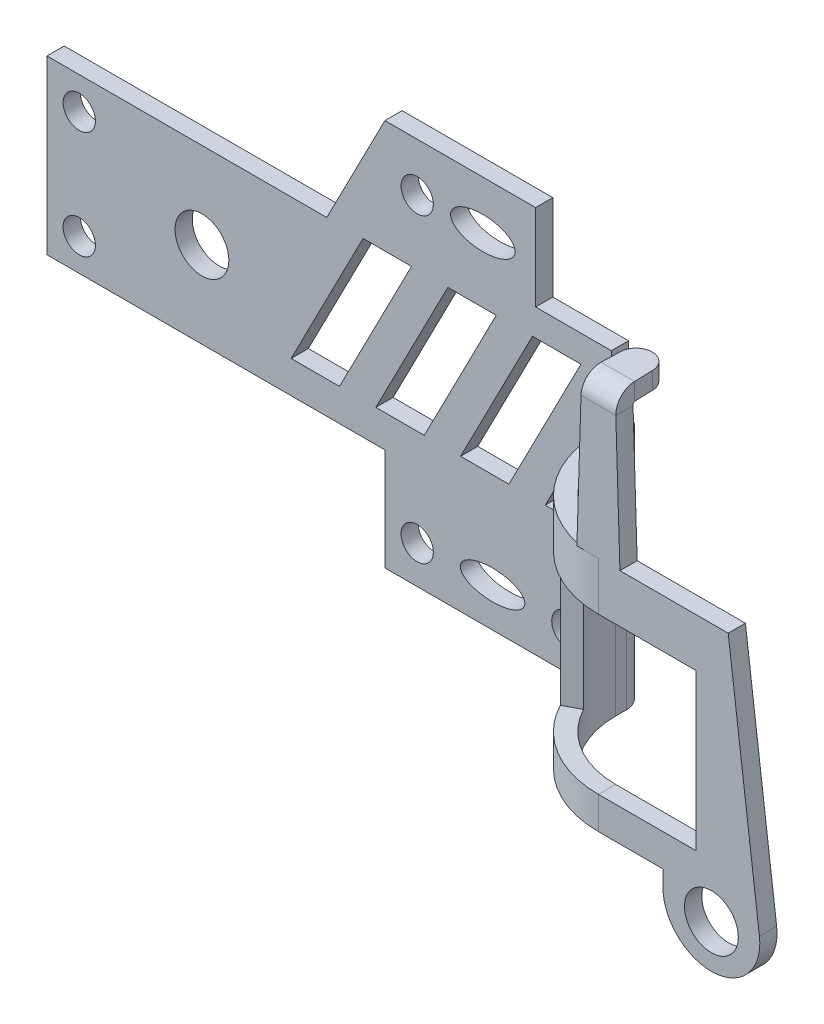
ISO-10303-21;
HEADER;
FILE_DESCRIPTION(('STEP AP214'),'2;1');
FILE_NAME('part.step','',(''),(''),'','','');
FILE_SCHEMA(('AUTOMOTIVE_DESIGN { 1 0 10303 214 1 1 1 1 }'));
ENDSEC;
DATA;
#1=APPLICATION_CONTEXT('core data for automotive mechanical design processes');
#2=APPLICATION_PROTOCOL_DEFINITION('international standard','automotive_design',2000,#1);
#3=PRODUCT_CONTEXT('',#1,'mechanical');
#4=PRODUCT('Part','Part','',(#3));
#5=PRODUCT_RELATED_PRODUCT_CATEGORY('part','',(#4));
#6=PRODUCT_DEFINITION_FORMATION('','',#4);
#7=PRODUCT_DEFINITION_CONTEXT('part definition',#1,'design');
#8=PRODUCT_DEFINITION('design','',#6,#7);
#9=PRODUCT_DEFINITION_SHAPE('','',#8);
#10=(LENGTH_UNIT() NAMED_UNIT(*) SI_UNIT(.MILLI.,.METRE.));
#11=(NAMED_UNIT(*) PLANE_ANGLE_UNIT() SI_UNIT($,.RADIAN.));
#12=(NAMED_UNIT(*) SI_UNIT($,.STERADIAN.) SOLID_ANGLE_UNIT());
#13=UNCERTAINTY_MEASURE_WITH_UNIT(LENGTH_MEASURE(1.E-05),#10,'distance_accuracy_value','');
#14=(GEOMETRIC_REPRESENTATION_CONTEXT(3) GLOBAL_UNCERTAINTY_ASSIGNED_CONTEXT((#13)) GLOBAL_UNIT_ASSIGNED_CONTEXT((#10,
#11,#12)) REPRESENTATION_CONTEXT('',''));
#15=CARTESIAN_POINT('',(0.,0.,0.));
#16=DIRECTION('',(0.,0.,1.));
#17=DIRECTION('',(1.,0.,0.));
#18=AXIS2_PLACEMENT_3D('',#15,#16,#17);
#19=CARTESIAN_POINT('',(14.57,11.,6.45000000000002));
#20=DIRECTION('',(0.999513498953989,-0.0311891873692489,0.));
#21=DIRECTION('',(0.0311891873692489,0.999513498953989,0.));
#22=AXIS2_PLACEMENT_3D('',#19,#20,#21);
#23=PLANE('',#22);
#24=DIRECTION('',(-0.0311891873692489,-0.999513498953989,0.));
#25=VECTOR('',#24,1.);
#26=CARTESIAN_POINT('',(14.57,11.,6.45000000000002));
#27=LINE('',#26,#25);
#28=CARTESIAN_POINT('',(14.7619068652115,17.15,6.45000000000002));
#29=VERTEX_POINT('',#28);
#30=CARTESIAN_POINT('',(14.57,11.,6.45000000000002));
#31=VERTEX_POINT('',#30);
#32=EDGE_CURVE('E572',#29,#31,#27,.T.);
#33=ORIENTED_EDGE('',*,*,#32,.F.);
#34=CARTESIAN_POINT('',(14.7619068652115,17.15,5.65000000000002));
#35=CARTESIAN_POINT('',(14.7619068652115,17.15,6.45000000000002));
#36=B_SPLINE_CURVE_WITH_KNOTS('',1,(#34,#35),.UNSPECIFIED.,.F.,.F.,(2,2),(0.,1.),.UNSPECIFIED.);
#37=CARTESIAN_POINT('',(14.7619068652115,17.15,5.65000000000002));
#38=VERTEX_POINT('',#37);
#39=EDGE_CURVE('E12',#29,#38,#36,.F.);
#40=ORIENTED_EDGE('',*,*,#39,.T.);
#41=DIRECTION('',(-0.0311891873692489,-0.999513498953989,0.));
#42=VECTOR('',#41,1.);
#43=CARTESIAN_POINT('',(14.57,11.,5.65000000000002));
#44=LINE('',#43,#42);
#45=CARTESIAN_POINT('',(14.57,11.,5.65000000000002));
#46=VERTEX_POINT('',#45);
#47=EDGE_CURVE('E563',#38,#46,#44,.T.);
#48=ORIENTED_EDGE('',*,*,#47,.T.);
#49=DIRECTION('',(0.,0.,-1.));
#50=VECTOR('',#49,1.);
#51=CARTESIAN_POINT('',(14.57,11.,1.40000000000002));
#52=LINE('',#51,#50);
#53=CARTESIAN_POINT('',(14.57,11.,6.35000000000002));
#54=VERTEX_POINT('',#53);
#55=EDGE_CURVE('E866',#54,#46,#52,.T.);
#56=ORIENTED_EDGE('',*,*,#55,.F.);
#57=DIRECTION('',(0.,0.,-1.));
#58=VECTOR('',#57,1.);
#59=CARTESIAN_POINT('',(14.57,11.,6.45000000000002));
#60=LINE('',#59,#58);
#61=EDGE_CURVE('E568',#31,#54,#60,.T.);
#62=ORIENTED_EDGE('',*,*,#61,.F.);
#63=EDGE_LOOP('',(#33,#40,#48,#56,#62));
#64=FACE_BOUND('',#63,.T.);
#65=ADVANCED_FACE('F58',(#64),#23,.F.);
#66=CARTESIAN_POINT('',(16.3196351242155,19.0233918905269,6.45000000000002));
#67=DIRECTION('',(-0.999513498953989,-0.0311891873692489,0.));
#68=DIRECTION('',(0.0311891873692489,-0.999513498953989,0.));
#69=AXIS2_PLACEMENT_3D('',#66,#67,#68);
#70=PLANE('',#69);
#71=DIRECTION('',(-0.0311891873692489,0.999513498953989,0.));
#72=VECTOR('',#71,1.);
#73=CARTESIAN_POINT('',(16.3196351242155,19.0233918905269,5.65000000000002));
#74=LINE('',#73,#72);
#75=CARTESIAN_POINT('',(16.57,11.,5.65000000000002));
#76=VERTEX_POINT('',#75);
#77=CARTESIAN_POINT('',(16.3780931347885,17.15,5.65000000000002));
#78=VERTEX_POINT('',#77);
#79=EDGE_CURVE('E567',#76,#78,#74,.T.);
#80=ORIENTED_EDGE('',*,*,#79,.T.);
#81=CARTESIAN_POINT('',(16.3780931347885,17.15,6.45000000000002));
#82=CARTESIAN_POINT('',(16.3780931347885,17.15,5.65000000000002));
#83=B_SPLINE_CURVE_WITH_KNOTS('',1,(#81,#82),.UNSPECIFIED.,.F.,.F.,(2,2),(0.,1.),.UNSPECIFIED.);
#84=CARTESIAN_POINT('',(16.3780931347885,17.15,6.45000000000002));
#85=VERTEX_POINT('',#84);
#86=EDGE_CURVE('E550',#78,#85,#83,.F.);
#87=ORIENTED_EDGE('',*,*,#86,.T.);
#88=DIRECTION('',(-0.0311891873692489,0.999513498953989,0.));
#89=VECTOR('',#88,1.);
#90=CARTESIAN_POINT('',(16.3196351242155,19.0233918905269,6.45000000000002));
#91=LINE('',#90,#89);
#92=CARTESIAN_POINT('',(16.57,11.,6.45000000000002));
#93=VERTEX_POINT('',#92);
#94=EDGE_CURVE('E562',#93,#85,#91,.T.);
#95=ORIENTED_EDGE('',*,*,#94,.F.);
#96=DIRECTION('',(0.,0.,-1.));
#97=VECTOR('',#96,1.);
#98=CARTESIAN_POINT('',(16.57,11.,6.45000000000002));
#99=LINE('',#98,#97);
#100=EDGE_CURVE('E571',#93,#76,#99,.T.);
#101=ORIENTED_EDGE('',*,*,#100,.T.);
#102=EDGE_LOOP('',(#80,#87,#95,#101));
#103=FACE_BOUND('',#102,.T.);
#104=ADVANCED_FACE('F787',(#103),#70,.F.);
#105=CARTESIAN_POINT('',(20.818845,-0.75,5.65000000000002));
#106=DIRECTION('',(0.,0.,1.));
#107=DIRECTION('',(1.,0.,0.));
#108=AXIS2_PLACEMENT_3D('',#105,#106,#107);
#109=PLANE('',#108);
#110=CARTESIAN_POINT('',(20.818845,-0.999999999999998,5.65000000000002));
#111=DIRECTION('',(0.,0.,1.));
#112=DIRECTION('',(1.,0.,0.));
#113=AXIS2_PLACEMENT_3D('',#110,#111,#112);
#114=CIRCLE('',#113,1.25);
#115=CARTESIAN_POINT('',(22.068845,-0.999999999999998,5.65000000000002));
#116=VERTEX_POINT('',#115);
#117=EDGE_CURVE('E630',#116,#116,#114,.T.);
#118=ORIENTED_EDGE('',*,*,#117,.T.);
#119=EDGE_LOOP('',(#118));
#120=FACE_BOUND('',#119,.T.);
#121=ORIENTED_EDGE('',*,*,#47,.F.);
#122=DIRECTION('',(1.,0.,0.));
#123=VECTOR('',#122,1.);
#124=CARTESIAN_POINT('',(20.818845,17.15,5.65000000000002));
#125=LINE('',#124,#123);
#126=EDGE_CURVE('E69',#38,#78,#125,.T.);
#127=ORIENTED_EDGE('',*,*,#126,.T.);
#128=ORIENTED_EDGE('',*,*,#79,.F.);
#129=DIRECTION('',(-1.,0.,0.));
#130=VECTOR('',#129,1.);
#131=CARTESIAN_POINT('',(13.65,11.,5.65000000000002));
#132=LINE('',#131,#130);
#133=CARTESIAN_POINT('',(21.6,11.,5.65000000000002));
#134=VERTEX_POINT('',#133);
#135=EDGE_CURVE('E624',#134,#76,#132,.T.);
#136=ORIENTED_EDGE('',*,*,#135,.F.);
#137=DIRECTION('',(-0.125533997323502,0.992089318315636,0.));
#138=VECTOR('',#137,1.);
#139=CARTESIAN_POINT('',(21.6,11.,5.65000000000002));
#140=LINE('',#139,#138);
#141=CARTESIAN_POINT('',(23.0510459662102,-0.467548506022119,5.65000000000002));
#142=VERTEX_POINT('',#141);
#143=EDGE_CURVE('E666',#142,#134,#140,.T.);
#144=ORIENTED_EDGE('',*,*,#143,.F.);
#145=CARTESIAN_POINT('',(20.818845,-0.75,5.65000000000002));
#146=DIRECTION('',(0.,0.,1.));
#147=DIRECTION('',(1.,0.,0.));
#148=AXIS2_PLACEMENT_3D('',#145,#146,#147);
#149=CIRCLE('',#148,2.25);
#150=CARTESIAN_POINT('',(18.568845,-0.75,5.65000000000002));
#151=VERTEX_POINT('',#150);
#152=EDGE_CURVE('E661',#151,#142,#149,.T.);
#153=ORIENTED_EDGE('',*,*,#152,.F.);
#154=DIRECTION('',(0.,-1.,0.));
#155=VECTOR('',#154,1.);
#156=CARTESIAN_POINT('',(18.568845,0.,5.65000000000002));
#157=LINE('',#156,#155);
#158=CARTESIAN_POINT('',(18.568845,0.,5.65000000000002));
#159=VERTEX_POINT('',#158);
#160=EDGE_CURVE('E656',#159,#151,#157,.T.);
#161=ORIENTED_EDGE('',*,*,#160,.F.);
#162=DIRECTION('',(1.,0.,0.));
#163=VECTOR('',#162,1.);
#164=CARTESIAN_POINT('',(18.568845,0.,5.65000000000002));
#165=LINE('',#164,#163);
#166=CARTESIAN_POINT('',(15.57,0.,5.65000000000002));
#167=VERTEX_POINT('',#166);
#168=EDGE_CURVE('E633',#167,#159,#165,.T.);
#169=ORIENTED_EDGE('',*,*,#168,.F.);
#170=DIRECTION('',(0.,-1.,0.));
#171=VECTOR('',#170,1.);
#172=CARTESIAN_POINT('',(15.57,-0.750000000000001,5.65000000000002));
#173=LINE('',#172,#171);
#174=CARTESIAN_POINT('',(15.57,1.5,5.65000000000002));
#175=VERTEX_POINT('',#174);
#176=EDGE_CURVE('E622',#175,#167,#173,.T.);
#177=ORIENTED_EDGE('',*,*,#176,.F.);
#178=DIRECTION('',(1.,0.,0.));
#179=VECTOR('',#178,1.);
#180=CARTESIAN_POINT('',(20.818845,1.5,5.65000000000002));
#181=LINE('',#180,#179);
#182=CARTESIAN_POINT('',(20.1,1.5,5.65000000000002));
#183=VERTEX_POINT('',#182);
#184=EDGE_CURVE('E600',#183,#175,#181,.F.);
#185=ORIENTED_EDGE('',*,*,#184,.F.);
#186=DIRECTION('',(0.,1.,0.));
#187=VECTOR('',#186,1.);
#188=CARTESIAN_POINT('',(20.1,-0.75,5.65000000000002));
#189=LINE('',#188,#187);
#190=CARTESIAN_POINT('',(20.1,8.75,5.65000000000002));
#191=VERTEX_POINT('',#190);
#192=EDGE_CURVE('E602',#191,#183,#189,.F.);
#193=ORIENTED_EDGE('',*,*,#192,.F.);
#194=DIRECTION('',(1.,0.,0.));
#195=VECTOR('',#194,1.);
#196=CARTESIAN_POINT('',(20.818845,8.75,5.65000000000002));
#197=LINE('',#196,#195);
#198=CARTESIAN_POINT('',(15.57,8.74999999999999,5.65000000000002));
#199=VERTEX_POINT('',#198);
#200=EDGE_CURVE('E598',#199,#191,#197,.T.);
#201=ORIENTED_EDGE('',*,*,#200,.F.);
#202=CARTESIAN_POINT('',(15.57,11.,5.65000000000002));
#203=VERTEX_POINT('',#202);
#204=EDGE_CURVE('E672',#203,#199,#173,.T.);
#205=ORIENTED_EDGE('',*,*,#204,.F.);
#206=DIRECTION('',(1.,0.,0.));
#207=VECTOR('',#206,1.);
#208=CARTESIAN_POINT('',(16.57,11.,5.65000000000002));
#209=LINE('',#208,#207);
#210=EDGE_CURVE('E564',#46,#203,#209,.T.);
#211=ORIENTED_EDGE('',*,*,#210,.F.);
#212=EDGE_LOOP('',(#121,#127,#128,#136,#144,#153,#161,#169,#177,#185,#193,#201,#205,#211));
#213=FACE_BOUND('',#212,.T.);
#214=ADVANCED_FACE('F790',(#120,#213),#109,.F.);
#215=CARTESIAN_POINT('',(15.57,11.,1.40000000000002));
#216=DIRECTION('',(0.,1.,0.));
#217=DIRECTION('',(-1.,0.,0.));
#218=AXIS2_PLACEMENT_3D('',#215,#216,#217);
#219=PLANE('',#218);
#220=CARTESIAN_POINT('',(15.57,11.,1.40000000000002));
#221=DIRECTION('',(0.,-1.,0.));
#222=DIRECTION('',(1.,0.,0.));
#223=AXIS2_PLACEMENT_3D('',#220,#221,#222);
#224=CIRCLE('',#223,5.05);
#225=CARTESIAN_POINT('',(10.52,11.,1.40000000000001));
#226=VERTEX_POINT('',#225);
#227=EDGE_CURVE('E679',#54,#226,#224,.T.);
#228=ORIENTED_EDGE('',*,*,#227,.F.);
#229=ORIENTED_EDGE('',*,*,#55,.T.);
#230=ORIENTED_EDGE('',*,*,#210,.T.);
#231=CARTESIAN_POINT('',(15.57,11.,1.40000000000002));
#232=DIRECTION('',(0.,1.,0.));
#233=DIRECTION('',(-1.,0.,0.));
#234=AXIS2_PLACEMENT_3D('',#231,#232,#233);
#235=CIRCLE('',#234,4.25);
#236=CARTESIAN_POINT('',(11.32,11.,1.4));
#237=VERTEX_POINT('',#236);
#238=EDGE_CURVE('E626',#203,#237,#235,.F.);
#239=ORIENTED_EDGE('',*,*,#238,.T.);
#240=DIRECTION('',(1.,0.,0.));
#241=VECTOR('',#240,1.);
#242=CARTESIAN_POINT('',(10.52,11.,1.4));
#243=LINE('',#242,#241);
#244=EDGE_CURVE('E884',#226,#237,#243,.T.);
#245=ORIENTED_EDGE('',*,*,#244,.F.);
#246=EDGE_LOOP('',(#228,#229,#230,#239,#245));
#247=FACE_BOUND('',#246,.T.);
#248=ADVANCED_FACE('F1590',(#247),#219,.T.);
#249=CARTESIAN_POINT('',(13.65,11.,6.45000000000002));
#250=DIRECTION('',(0.,-1.,0.));
#251=DIRECTION('',(0.,0.,-1.));
#252=AXIS2_PLACEMENT_3D('',#249,#250,#251);
#253=PLANE('',#252);
#254=ORIENTED_EDGE('',*,*,#100,.F.);
#255=DIRECTION('',(-1.,0.,0.));
#256=VECTOR('',#255,1.);
#257=CARTESIAN_POINT('',(14.75,11.,6.45000000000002));
#258=LINE('',#257,#256);
#259=CARTESIAN_POINT('',(21.6,11.,6.45000000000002));
#260=VERTEX_POINT('',#259);
#261=EDGE_CURVE('E647',#260,#93,#258,.T.);
#262=ORIENTED_EDGE('',*,*,#261,.F.);
#263=DIRECTION('',(0.,0.,-1.));
#264=VECTOR('',#263,1.);
#265=CARTESIAN_POINT('',(21.6,11.,6.45000000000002));
#266=LINE('',#265,#264);
#267=EDGE_CURVE('E627',#260,#134,#266,.T.);
#268=ORIENTED_EDGE('',*,*,#267,.T.);
#269=ORIENTED_EDGE('',*,*,#135,.T.);
#270=EDGE_LOOP('',(#254,#262,#268,#269));
#271=FACE_BOUND('',#270,.T.);
#272=ADVANCED_FACE('F1595',(#271),#253,.F.);
#273=CARTESIAN_POINT('',(15.57,-5.5742945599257,1.40000000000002));
#274=DIRECTION('',(0.,1.,0.));
#275=DIRECTION('',(-1.,0.,0.));
#276=AXIS2_PLACEMENT_3D('',#273,#274,#275);
#277=CYLINDRICAL_SURFACE('',#276,5.05);
#278=DIRECTION('',(0.,-1.,0.));
#279=VECTOR('',#278,1.);
#280=CARTESIAN_POINT('',(15.57,-0.750000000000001,6.45000000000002));
#281=LINE('',#280,#279);
#282=CARTESIAN_POINT('',(15.57,1.5,6.45000000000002));
#283=VERTEX_POINT('',#282);
#284=CARTESIAN_POINT('',(15.57,0.,6.45000000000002));
#285=VERTEX_POINT('',#284);
#286=EDGE_CURVE('E646',#283,#285,#281,.T.);
#287=ORIENTED_EDGE('',*,*,#286,.F.);
#288=CARTESIAN_POINT('',(15.57,1.5,1.40000000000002));
#289=DIRECTION('',(0.,1.,0.));
#290=DIRECTION('',(-1.,0.,0.));
#291=AXIS2_PLACEMENT_3D('',#288,#289,#290);
#292=CIRCLE('',#291,5.05);
#293=CARTESIAN_POINT('',(11.1001006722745,1.5,3.74999999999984));
#294=VERTEX_POINT('',#293);
#295=EDGE_CURVE('E580',#283,#294,#292,.F.);
#296=ORIENTED_EDGE('',*,*,#295,.T.);
#297=DIRECTION('',(0.,1.,0.));
#298=VECTOR('',#297,1.);
#299=CARTESIAN_POINT('',(11.1001006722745,-5.5742945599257,3.74999999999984));
#300=LINE('',#299,#298);
#301=CARTESIAN_POINT('',(11.1001006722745,8.75,3.74999999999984));
#302=VERTEX_POINT('',#301);
#303=EDGE_CURVE('E587',#294,#302,#300,.T.);
#304=ORIENTED_EDGE('',*,*,#303,.T.);
#305=CARTESIAN_POINT('',(15.57,8.75,1.40000000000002));
#306=DIRECTION('',(0.,-1.,0.));
#307=DIRECTION('',(1.,0.,0.));
#308=AXIS2_PLACEMENT_3D('',#305,#306,#307);
#309=CIRCLE('',#308,5.05);
#310=CARTESIAN_POINT('',(15.57,8.75,6.44999999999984));
#311=VERTEX_POINT('',#310);
#312=EDGE_CURVE('E575',#302,#311,#309,.F.);
#313=ORIENTED_EDGE('',*,*,#312,.T.);
#314=CARTESIAN_POINT('',(15.57,11.,6.45000000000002));
#315=VERTEX_POINT('',#314);
#316=EDGE_CURVE('E643',#315,#311,#281,.T.);
#317=ORIENTED_EDGE('',*,*,#316,.F.);
#318=EDGE_CURVE('E675',#315,#54,#224,.T.);
#319=ORIENTED_EDGE('',*,*,#318,.T.);
#320=ORIENTED_EDGE('',*,*,#227,.T.);
#321=DIRECTION('',(0.,-1.,0.));
#322=VECTOR('',#321,1.);
#323=CARTESIAN_POINT('',(10.52,-0.750000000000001,1.4));
#324=LINE('',#323,#322);
#325=CARTESIAN_POINT('',(10.52,0.,1.40000000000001));
#326=VERTEX_POINT('',#325);
#327=EDGE_CURVE('E905',#226,#326,#324,.T.);
#328=ORIENTED_EDGE('',*,*,#327,.T.);
#329=CARTESIAN_POINT('',(15.57,0.,1.40000000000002));
#330=DIRECTION('',(0.,1.,0.));
#331=DIRECTION('',(0.,0.,1.));
#332=AXIS2_PLACEMENT_3D('',#329,#330,#331);
#333=CIRCLE('',#332,5.05);
#334=EDGE_CURVE('E678',#326,#285,#333,.T.);
#335=ORIENTED_EDGE('',*,*,#334,.T.);
#336=EDGE_LOOP('',(#287,#296,#304,#313,#317,#319,#320,#328,#335));
#337=FACE_BOUND('',#336,.T.);
#338=ADVANCED_FACE('F1516',(#337),#277,.T.);
#339=CARTESIAN_POINT('',(15.57,-5.5742945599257,1.40000000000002));
#340=DIRECTION('',(0.,1.,0.));
#341=DIRECTION('',(-1.,0.,0.));
#342=AXIS2_PLACEMENT_3D('',#339,#340,#341);
#343=CYLINDRICAL_SURFACE('',#342,4.25);
#344=CARTESIAN_POINT('',(15.57,1.5,1.40000000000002));
#345=DIRECTION('',(0.,1.,0.));
#346=DIRECTION('',(-1.,0.,0.));
#347=AXIS2_PLACEMENT_3D('',#344,#345,#346);
#348=CIRCLE('',#347,4.25);
#349=CARTESIAN_POINT('',(11.8082035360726,1.5,3.3777227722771));
#350=VERTEX_POINT('',#349);
#351=EDGE_CURVE('E581',#175,#350,#348,.F.);
#352=ORIENTED_EDGE('',*,*,#351,.F.);
#353=ORIENTED_EDGE('',*,*,#176,.T.);
#354=CARTESIAN_POINT('',(15.57,0.,1.40000000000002));
#355=DIRECTION('',(0.,1.,0.));
#356=DIRECTION('',(-1.,0.,0.));
#357=AXIS2_PLACEMENT_3D('',#354,#355,#356);
#358=CIRCLE('',#357,4.25);
#359=CARTESIAN_POINT('',(11.32,0.,1.40000000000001));
#360=VERTEX_POINT('',#359);
#361=EDGE_CURVE('E683',#360,#167,#358,.T.);
#362=ORIENTED_EDGE('',*,*,#361,.F.);
#363=DIRECTION('',(0.,-1.,0.));
#364=VECTOR('',#363,1.);
#365=CARTESIAN_POINT('',(11.32,-0.750000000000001,1.4));
#366=LINE('',#365,#364);
#367=EDGE_CURVE('E899',#237,#360,#366,.T.);
#368=ORIENTED_EDGE('',*,*,#367,.F.);
#369=ORIENTED_EDGE('',*,*,#238,.F.);
#370=ORIENTED_EDGE('',*,*,#204,.T.);
#371=CARTESIAN_POINT('',(15.57,8.75,1.40000000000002));
#372=DIRECTION('',(0.,1.,0.));
#373=DIRECTION('',(-1.,0.,0.));
#374=AXIS2_PLACEMENT_3D('',#371,#372,#373);
#375=CIRCLE('',#374,4.25);
#376=CARTESIAN_POINT('',(11.8082035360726,8.75,3.3777227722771));
#377=VERTEX_POINT('',#376);
#378=EDGE_CURVE('E576',#377,#199,#375,.T.);
#379=ORIENTED_EDGE('',*,*,#378,.F.);
#380=DIRECTION('',(0.,1.,0.));
#381=VECTOR('',#380,1.);
#382=CARTESIAN_POINT('',(11.8082035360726,-5.5742945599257,3.3777227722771));
#383=LINE('',#382,#381);
#384=EDGE_CURVE('E579',#350,#377,#383,.T.);
#385=ORIENTED_EDGE('',*,*,#384,.F.);
#386=EDGE_LOOP('',(#352,#353,#362,#368,#369,#370,#379,#385));
#387=FACE_BOUND('',#386,.T.);
#388=ADVANCED_FACE('F785',(#387),#343,.F.);
#389=CARTESIAN_POINT('',(20.818845,-0.75,6.45000000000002));
#390=DIRECTION('',(0.,0.,1.));
#391=DIRECTION('',(1.,0.,0.));
#392=AXIS2_PLACEMENT_3D('',#389,#390,#391);
#393=PLANE('',#392);
#394=DIRECTION('',(1.,0.,0.));
#395=VECTOR('',#394,1.);
#396=CARTESIAN_POINT('',(20.818845,17.15,6.45000000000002));
#397=LINE('',#396,#395);
#398=EDGE_CURVE('E864',#29,#85,#397,.T.);
#399=ORIENTED_EDGE('',*,*,#398,.F.);
#400=ORIENTED_EDGE('',*,*,#32,.T.);
#401=DIRECTION('',(1.,0.,0.));
#402=VECTOR('',#401,1.);
#403=CARTESIAN_POINT('',(16.57,11.,6.45000000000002));
#404=LINE('',#403,#402);
#405=EDGE_CURVE('E554',#31,#315,#404,.T.);
#406=ORIENTED_EDGE('',*,*,#405,.T.);
#407=ORIENTED_EDGE('',*,*,#316,.T.);
#408=DIRECTION('',(1.,0.,0.));
#409=VECTOR('',#408,1.);
#410=CARTESIAN_POINT('',(10.42,8.75,6.44999999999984));
#411=LINE('',#410,#409);
#412=CARTESIAN_POINT('',(20.1,8.75,6.45000000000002));
#413=VERTEX_POINT('',#412);
#414=EDGE_CURVE('E595',#311,#413,#411,.T.);
#415=ORIENTED_EDGE('',*,*,#414,.T.);
#416=DIRECTION('',(0.,-1.,0.));
#417=VECTOR('',#416,1.);
#418=CARTESIAN_POINT('',(20.1,8.75,6.44999999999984));
#419=LINE('',#418,#417);
#420=CARTESIAN_POINT('',(20.1,1.5,6.45000000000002));
#421=VERTEX_POINT('',#420);
#422=EDGE_CURVE('E601',#413,#421,#419,.T.);
#423=ORIENTED_EDGE('',*,*,#422,.T.);
#424=DIRECTION('',(-1.,0.,0.));
#425=VECTOR('',#424,1.);
#426=CARTESIAN_POINT('',(10.42,1.5,6.44999999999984));
#427=LINE('',#426,#425);
#428=EDGE_CURVE('E608',#421,#283,#427,.T.);
#429=ORIENTED_EDGE('',*,*,#428,.T.);
#430=ORIENTED_EDGE('',*,*,#286,.T.);
#431=DIRECTION('',(1.,0.,0.));
#432=VECTOR('',#431,1.);
#433=CARTESIAN_POINT('',(14.75,0.,6.45000000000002));
#434=LINE('',#433,#432);
#435=CARTESIAN_POINT('',(18.568845,0.,6.45000000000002));
#436=VERTEX_POINT('',#435);
#437=EDGE_CURVE('E641',#285,#436,#434,.T.);
#438=ORIENTED_EDGE('',*,*,#437,.T.);
#439=DIRECTION('',(0.,-1.,0.));
#440=VECTOR('',#439,1.);
#441=CARTESIAN_POINT('',(18.568845,0.,6.45000000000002));
#442=LINE('',#441,#440);
#443=CARTESIAN_POINT('',(18.568845,-0.75,6.45000000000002));
#444=VERTEX_POINT('',#443);
#445=EDGE_CURVE('E639',#436,#444,#442,.T.);
#446=ORIENTED_EDGE('',*,*,#445,.T.);
#447=CARTESIAN_POINT('',(20.818845,-0.75,6.45000000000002));
#448=DIRECTION('',(0.,0.,1.));
#449=DIRECTION('',(1.,0.,0.));
#450=AXIS2_PLACEMENT_3D('',#447,#448,#449);
#451=CIRCLE('',#450,2.25);
#452=CARTESIAN_POINT('',(23.0510459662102,-0.46754850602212,6.45000000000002));
#453=VERTEX_POINT('',#452);
#454=EDGE_CURVE('E637',#444,#453,#451,.T.);
#455=ORIENTED_EDGE('',*,*,#454,.T.);
#456=DIRECTION('',(-0.125533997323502,0.992089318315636,0.));
#457=VECTOR('',#456,1.);
#458=CARTESIAN_POINT('',(21.6,11.,6.45000000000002));
#459=LINE('',#458,#457);
#460=EDGE_CURVE('E635',#453,#260,#459,.T.);
#461=ORIENTED_EDGE('',*,*,#460,.T.);
#462=ORIENTED_EDGE('',*,*,#261,.T.);
#463=ORIENTED_EDGE('',*,*,#94,.T.);
#464=EDGE_LOOP('',(#399,#400,#406,#407,#415,#423,#429,#430,#438,#446,#455,#461,#462,#463));
#465=FACE_BOUND('',#464,.T.);
#466=CARTESIAN_POINT('',(20.818845,-0.999999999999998,6.45000000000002));
#467=DIRECTION('',(0.,0.,1.));
#468=DIRECTION('',(1.,0.,0.));
#469=AXIS2_PLACEMENT_3D('',#466,#467,#468);
#470=CIRCLE('',#469,1.25);
#471=CARTESIAN_POINT('',(22.068845,-0.999999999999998,6.45000000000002));
#472=VERTEX_POINT('',#471);
#473=EDGE_CURVE('E650',#472,#472,#470,.T.);
#474=ORIENTED_EDGE('',*,*,#473,.F.);
#475=EDGE_LOOP('',(#474));
#476=FACE_BOUND('',#475,.T.);
#477=ADVANCED_FACE('F775',(#465,#476),#393,.T.);
#478=CARTESIAN_POINT('',(10.52,0.,5.398845));
#479=DIRECTION('',(0.,1.,0.));
#480=DIRECTION('',(0.,0.,-1.));
#481=AXIS2_PLACEMENT_3D('',#478,#479,#480);
#482=PLANE('',#481);
#483=DIRECTION('',(0.,0.,1.));
#484=VECTOR('',#483,1.);
#485=CARTESIAN_POINT('',(11.32,0.,5.398845));
#486=LINE('',#485,#484);
#487=CARTESIAN_POINT('',(11.32,0.,0.900000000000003));
#488=VERTEX_POINT('',#487);
#489=EDGE_CURVE('E892',#488,#360,#486,.T.);
#490=ORIENTED_EDGE('',*,*,#489,.T.);
#491=DIRECTION('',(-1.,0.,0.));
#492=VECTOR('',#491,1.);
#493=CARTESIAN_POINT('',(10.52,0.,1.4));
#494=LINE('',#493,#492);
#495=EDGE_CURVE('E902',#360,#326,#494,.T.);
#496=ORIENTED_EDGE('',*,*,#495,.T.);
#497=DIRECTION('',(0.,0.,1.));
#498=VECTOR('',#497,1.);
#499=CARTESIAN_POINT('',(10.52,0.,1.58));
#500=LINE('',#499,#498);
#501=CARTESIAN_POINT('',(10.52,0.,0.899999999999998));
#502=VERTEX_POINT('',#501);
#503=EDGE_CURVE('E888',#502,#326,#500,.T.);
#504=ORIENTED_EDGE('',*,*,#503,.F.);
#505=DIRECTION('',(1.,0.,0.));
#506=VECTOR('',#505,1.);
#507=CARTESIAN_POINT('',(10.52,0.,0.899999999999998));
#508=LINE('',#507,#506);
#509=EDGE_CURVE('E907',#502,#488,#508,.T.);
#510=ORIENTED_EDGE('',*,*,#509,.T.);
#511=EDGE_LOOP('',(#490,#496,#504,#510));
#512=FACE_BOUND('',#511,.T.);
#513=ADVANCED_FACE('F771',(#512),#482,.F.);
#514=CARTESIAN_POINT('',(11.32,-0.750000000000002,7.648845));
#515=DIRECTION('',(-1.,0.,0.));
#516=DIRECTION('',(0.,0.,1.));
#517=AXIS2_PLACEMENT_3D('',#514,#515,#516);
#518=PLANE('',#517);
#519=DIRECTION('',(0.,0.,-1.));
#520=VECTOR('',#519,1.);
#521=CARTESIAN_POINT('',(11.32,11.,0.480000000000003));
#522=LINE('',#521,#520);
#523=CARTESIAN_POINT('',(11.32,11.,0.900000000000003));
#524=VERTEX_POINT('',#523);
#525=EDGE_CURVE('E891',#237,#524,#522,.T.);
#526=ORIENTED_EDGE('',*,*,#525,.F.);
#527=ORIENTED_EDGE('',*,*,#367,.T.);
#528=ORIENTED_EDGE('',*,*,#489,.F.);
#529=DIRECTION('',(0.,1.,0.));
#530=VECTOR('',#529,1.);
#531=CARTESIAN_POINT('',(11.32,-0.750000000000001,0.900000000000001));
#532=LINE('',#531,#530);
#533=EDGE_CURVE('E910',#488,#524,#532,.T.);
#534=ORIENTED_EDGE('',*,*,#533,.T.);
#535=EDGE_LOOP('',(#526,#527,#528,#534));
#536=FACE_BOUND('',#535,.T.);
#537=ADVANCED_FACE('F774',(#536),#518,.F.);
#538=CARTESIAN_POINT('',(10.52,11.,0.48));
#539=DIRECTION('',(0.,-1.,0.));
#540=DIRECTION('',(1.,0.,0.));
#541=AXIS2_PLACEMENT_3D('',#538,#539,#540);
#542=PLANE('',#541);
#543=DIRECTION('',(0.,0.,-1.));
#544=VECTOR('',#543,1.);
#545=CARTESIAN_POINT('',(10.52,11.,1.58));
#546=LINE('',#545,#544);
#547=CARTESIAN_POINT('',(10.52,11.,0.9));
#548=VERTEX_POINT('',#547);
#549=EDGE_CURVE('E885',#226,#548,#546,.T.);
#550=ORIENTED_EDGE('',*,*,#549,.F.);
#551=ORIENTED_EDGE('',*,*,#244,.T.);
#552=ORIENTED_EDGE('',*,*,#525,.T.);
#553=DIRECTION('',(-1.,0.,0.));
#554=VECTOR('',#553,1.);
#555=CARTESIAN_POINT('',(10.52,11.,0.9));
#556=LINE('',#555,#554);
#557=EDGE_CURVE('E913',#524,#548,#556,.T.);
#558=ORIENTED_EDGE('',*,*,#557,.T.);
#559=EDGE_LOOP('',(#550,#551,#552,#558));
#560=FACE_BOUND('',#559,.T.);
#561=ADVANCED_FACE('F769',(#560),#542,.F.);
#562=CARTESIAN_POINT('',(10.52,-0.750000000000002,7.648845));
#563=DIRECTION('',(-1.,0.,0.));
#564=DIRECTION('',(0.,0.,1.));
#565=AXIS2_PLACEMENT_3D('',#562,#563,#564);
#566=PLANE('',#565);
#567=ORIENTED_EDGE('',*,*,#327,.F.);
#568=ORIENTED_EDGE('',*,*,#549,.T.);
#569=DIRECTION('',(0.,1.,0.));
#570=VECTOR('',#569,1.);
#571=CARTESIAN_POINT('',(10.52,-0.750000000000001,0.899999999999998));
#572=LINE('',#571,#570);
#573=EDGE_CURVE('E887',#502,#548,#572,.T.);
#574=ORIENTED_EDGE('',*,*,#573,.F.);
#575=ORIENTED_EDGE('',*,*,#503,.T.);
#576=EDGE_LOOP('',(#567,#568,#574,#575));
#577=FACE_BOUND('',#576,.T.);
#578=ADVANCED_FACE('F765',(#577),#566,.T.);
#579=CARTESIAN_POINT('',(0.,0.,0.8));
#580=DIRECTION('',(1.,0.,0.));
#581=DIRECTION('',(0.,0.,-1.));
#582=AXIS2_PLACEMENT_3D('',#579,#580,#581);
#583=PLANE('',#582);
#584=DIRECTION('',(0.,-1.,0.));
#585=VECTOR('',#584,1.);
#586=CARTESIAN_POINT('',(0.,0.,0.));
#587=LINE('',#586,#585);
#588=CARTESIAN_POINT('',(0.,4.75,0.));
#589=VERTEX_POINT('',#588);
#590=CARTESIAN_POINT('',(0.,0.,0.));
#591=VERTEX_POINT('',#590);
#592=EDGE_CURVE('E398',#589,#591,#587,.T.);
#593=ORIENTED_EDGE('',*,*,#592,.T.);
#594=DIRECTION('',(0.,0.,-1.));
#595=VECTOR('',#594,1.);
#596=CARTESIAN_POINT('',(0.,0.,0.8));
#597=LINE('',#596,#595);
#598=CARTESIAN_POINT('',(0.,0.,0.8));
#599=VERTEX_POINT('',#598);
#600=EDGE_CURVE('E1135',#599,#591,#597,.T.);
#601=ORIENTED_EDGE('',*,*,#600,.F.);
#602=DIRECTION('',(0.,-1.,0.));
#603=VECTOR('',#602,1.);
#604=CARTESIAN_POINT('',(0.,0.,0.8));
#605=LINE('',#604,#603);
#606=CARTESIAN_POINT('',(0.,4.75,0.8));
#607=VERTEX_POINT('',#606);
#608=EDGE_CURVE('E1064',#607,#599,#605,.T.);
#609=ORIENTED_EDGE('',*,*,#608,.F.);
#610=DIRECTION('',(0.,0.,-1.));
#611=VECTOR('',#610,1.);
#612=CARTESIAN_POINT('',(0.,4.75,0.8));
#613=LINE('',#612,#611);
#614=EDGE_CURVE('E921',#607,#589,#613,.T.);
#615=ORIENTED_EDGE('',*,*,#614,.T.);
#616=EDGE_LOOP('',(#593,#601,#609,#615));
#617=FACE_BOUND('',#616,.T.);
#618=ADVANCED_FACE('F768',(#617),#583,.F.);
#619=CARTESIAN_POINT('',(0.,4.75,0.8));
#620=DIRECTION('',(0.,1.,0.));
#621=DIRECTION('',(0.,0.,1.));
#622=AXIS2_PLACEMENT_3D('',#619,#620,#621);
#623=PLANE('',#622);
#624=DIRECTION('',(1.,0.,0.));
#625=VECTOR('',#624,1.);
#626=CARTESIAN_POINT('',(0.,4.75,0.));
#627=LINE('',#626,#625);
#628=CARTESIAN_POINT('',(-15.7,4.75,0.));
#629=VERTEX_POINT('',#628);
#630=EDGE_CURVE('E924',#629,#589,#627,.T.);
#631=ORIENTED_EDGE('',*,*,#630,.T.);
#632=ORIENTED_EDGE('',*,*,#614,.F.);
#633=DIRECTION('',(1.,0.,0.));
#634=VECTOR('',#633,1.);
#635=CARTESIAN_POINT('',(0.,4.75,0.8));
#636=LINE('',#635,#634);
#637=CARTESIAN_POINT('',(-15.7,4.75,0.8));
#638=VERTEX_POINT('',#637);
#639=EDGE_CURVE('E1062',#638,#607,#636,.T.);
#640=ORIENTED_EDGE('',*,*,#639,.F.);
#641=DIRECTION('',(0.,0.,-1.));
#642=VECTOR('',#641,1.);
#643=CARTESIAN_POINT('',(-15.7,4.75,0.8));
#644=LINE('',#643,#642);
#645=EDGE_CURVE('E926',#638,#629,#644,.T.);
#646=ORIENTED_EDGE('',*,*,#645,.T.);
#647=EDGE_LOOP('',(#631,#632,#640,#646));
#648=FACE_BOUND('',#647,.T.);
#649=ADVANCED_FACE('F1147',(#648),#623,.F.);
#650=CARTESIAN_POINT('',(-15.7,4.75,0.8));
#651=DIRECTION('',(1.,0.,0.));
#652=DIRECTION('',(0.,1.,0.));
#653=AXIS2_PLACEMENT_3D('',#650,#651,#652);
#654=PLANE('',#653);
#655=DIRECTION('',(0.,-1.,0.));
#656=VECTOR('',#655,1.);
#657=CARTESIAN_POINT('',(-15.7,4.75,0.));
#658=LINE('',#657,#656);
#659=CARTESIAN_POINT('',(-15.7,12.75,0.));
#660=VERTEX_POINT('',#659);
#661=EDGE_CURVE('E929',#660,#629,#658,.T.);
#662=ORIENTED_EDGE('',*,*,#661,.T.);
#663=ORIENTED_EDGE('',*,*,#645,.F.);
#664=DIRECTION('',(0.,-1.,0.));
#665=VECTOR('',#664,1.);
#666=CARTESIAN_POINT('',(-15.7,4.75,0.8));
#667=LINE('',#666,#665);
#668=CARTESIAN_POINT('',(-15.7,12.75,0.8));
#669=VERTEX_POINT('',#668);
#670=EDGE_CURVE('E1060',#669,#638,#667,.T.);
#671=ORIENTED_EDGE('',*,*,#670,.F.);
#672=DIRECTION('',(0.,0.,-1.));
#673=VECTOR('',#672,1.);
#674=CARTESIAN_POINT('',(-15.7,12.75,0.8));
#675=LINE('',#674,#673);
#676=EDGE_CURVE('E931',#669,#660,#675,.T.);
#677=ORIENTED_EDGE('',*,*,#676,.T.);
#678=EDGE_LOOP('',(#662,#663,#671,#677));
#679=FACE_BOUND('',#678,.T.);
#680=ADVANCED_FACE('F1153',(#679),#654,.F.);
#681=CARTESIAN_POINT('',(-15.7,12.75,0.8));
#682=DIRECTION('',(0.,-1.,0.));
#683=DIRECTION('',(0.,0.,-1.));
#684=AXIS2_PLACEMENT_3D('',#681,#682,#683);
#685=PLANE('',#684);
#686=DIRECTION('',(-1.,0.,0.));
#687=VECTOR('',#686,1.);
#688=CARTESIAN_POINT('',(-15.7,12.75,0.));
#689=LINE('',#688,#687);
#690=CARTESIAN_POINT('',(-2.7,12.75,0.));
#691=VERTEX_POINT('',#690);
#692=EDGE_CURVE('E934',#691,#660,#689,.T.);
#693=ORIENTED_EDGE('',*,*,#692,.T.);
#694=ORIENTED_EDGE('',*,*,#676,.F.);
#695=DIRECTION('',(-1.,0.,0.));
#696=VECTOR('',#695,1.);
#697=CARTESIAN_POINT('',(-15.7,12.75,0.8));
#698=LINE('',#697,#696);
#699=CARTESIAN_POINT('',(-2.7,12.75,0.8));
#700=VERTEX_POINT('',#699);
#701=EDGE_CURVE('E1058',#700,#669,#698,.T.);
#702=ORIENTED_EDGE('',*,*,#701,.F.);
#703=DIRECTION('',(0.,0.,-1.));
#704=VECTOR('',#703,1.);
#705=CARTESIAN_POINT('',(-2.7,12.75,0.8));
#706=LINE('',#705,#704);
#707=EDGE_CURVE('E936',#700,#691,#706,.T.);
#708=ORIENTED_EDGE('',*,*,#707,.T.);
#709=EDGE_LOOP('',(#693,#694,#702,#708));
#710=FACE_BOUND('',#709,.T.);
#711=ADVANCED_FACE('F1158',(#710),#685,.F.);
#712=CARTESIAN_POINT('',(-2.7,12.75,0.8));
#713=DIRECTION('',(0.889287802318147,-0.457348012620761,0.));
#714=DIRECTION('',(0.457348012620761,0.889287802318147,0.));
#715=AXIS2_PLACEMENT_3D('',#712,#713,#714);
#716=PLANE('',#715);
#717=DIRECTION('',(-0.457348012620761,-0.889287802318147,0.));
#718=VECTOR('',#717,1.);
#719=CARTESIAN_POINT('',(-2.7,12.75,0.));
#720=LINE('',#719,#718);
#721=CARTESIAN_POINT('',(0.,18.,0.));
#722=VERTEX_POINT('',#721);
#723=EDGE_CURVE('E939',#722,#691,#720,.T.);
#724=ORIENTED_EDGE('',*,*,#723,.T.);
#725=ORIENTED_EDGE('',*,*,#707,.F.);
#726=DIRECTION('',(-0.457348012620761,-0.889287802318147,0.));
#727=VECTOR('',#726,1.);
#728=CARTESIAN_POINT('',(-2.7,12.75,0.8));
#729=LINE('',#728,#727);
#730=CARTESIAN_POINT('',(0.,18.,0.8));
#731=VERTEX_POINT('',#730);
#732=EDGE_CURVE('E1056',#731,#700,#729,.T.);
#733=ORIENTED_EDGE('',*,*,#732,.F.);
#734=DIRECTION('',(0.,0.,-1.));
#735=VECTOR('',#734,1.);
#736=CARTESIAN_POINT('',(0.,18.,0.8));
#737=LINE('',#736,#735);
#738=EDGE_CURVE('E941',#731,#722,#737,.T.);
#739=ORIENTED_EDGE('',*,*,#738,.T.);
#740=EDGE_LOOP('',(#724,#725,#733,#739));
#741=FACE_BOUND('',#740,.T.);
#742=ADVANCED_FACE('F1162',(#741),#716,.F.);
#743=CARTESIAN_POINT('',(0.,18.,0.8));
#744=DIRECTION('',(0.,-1.,0.));
#745=DIRECTION('',(1.,0.,0.));
#746=AXIS2_PLACEMENT_3D('',#743,#744,#745);
#747=PLANE('',#746);
#748=DIRECTION('',(-1.,0.,0.));
#749=VECTOR('',#748,1.);
#750=CARTESIAN_POINT('',(0.,18.,0.));
#751=LINE('',#750,#749);
#752=CARTESIAN_POINT('',(7.,18.,0.));
#753=VERTEX_POINT('',#752);
#754=EDGE_CURVE('E944',#753,#722,#751,.T.);
#755=ORIENTED_EDGE('',*,*,#754,.T.);
#756=ORIENTED_EDGE('',*,*,#738,.F.);
#757=DIRECTION('',(-1.,0.,0.));
#758=VECTOR('',#757,1.);
#759=CARTESIAN_POINT('',(0.,18.,0.8));
#760=LINE('',#759,#758);
#761=CARTESIAN_POINT('',(7.,18.,0.8));
#762=VERTEX_POINT('',#761);
#763=EDGE_CURVE('E1054',#762,#731,#760,.T.);
#764=ORIENTED_EDGE('',*,*,#763,.F.);
#765=DIRECTION('',(0.,0.,-1.));
#766=VECTOR('',#765,1.);
#767=CARTESIAN_POINT('',(7.,18.,0.8));
#768=LINE('',#767,#766);
#769=EDGE_CURVE('E946',#762,#753,#768,.T.);
#770=ORIENTED_EDGE('',*,*,#769,.T.);
#771=EDGE_LOOP('',(#755,#756,#764,#770));
#772=FACE_BOUND('',#771,.T.);
#773=ADVANCED_FACE('F1167',(#772),#747,.F.);
#774=CARTESIAN_POINT('',(7.,18.,0.8));
#775=DIRECTION('',(-1.,0.,0.));
#776=DIRECTION('',(0.,-1.,0.));
#777=AXIS2_PLACEMENT_3D('',#774,#775,#776);
#778=PLANE('',#777);
#779=DIRECTION('',(0.,1.,0.));
#780=VECTOR('',#779,1.);
#781=CARTESIAN_POINT('',(7.,18.,0.));
#782=LINE('',#781,#780);
#783=CARTESIAN_POINT('',(7.,14.,0.));
#784=VERTEX_POINT('',#783);
#785=EDGE_CURVE('E949',#784,#753,#782,.T.);
#786=ORIENTED_EDGE('',*,*,#785,.T.);
#787=ORIENTED_EDGE('',*,*,#769,.F.);
#788=DIRECTION('',(0.,1.,0.));
#789=VECTOR('',#788,1.);
#790=CARTESIAN_POINT('',(7.,18.,0.8));
#791=LINE('',#790,#789);
#792=CARTESIAN_POINT('',(7.,14.,0.8));
#793=VERTEX_POINT('',#792);
#794=EDGE_CURVE('E1052',#793,#762,#791,.T.);
#795=ORIENTED_EDGE('',*,*,#794,.F.);
#796=DIRECTION('',(0.,0.,-1.));
#797=VECTOR('',#796,1.);
#798=CARTESIAN_POINT('',(7.,14.,0.8));
#799=LINE('',#798,#797);
#800=EDGE_CURVE('E951',#793,#784,#799,.T.);
#801=ORIENTED_EDGE('',*,*,#800,.T.);
#802=EDGE_LOOP('',(#786,#787,#795,#801));
#803=FACE_BOUND('',#802,.T.);
#804=ADVANCED_FACE('F1172',(#803),#778,.F.);
#805=CARTESIAN_POINT('',(7.,14.,0.8));
#806=DIRECTION('',(0.,-1.,0.));
#807=DIRECTION('',(0.,0.,-1.));
#808=AXIS2_PLACEMENT_3D('',#805,#806,#807);
#809=PLANE('',#808);
#810=DIRECTION('',(-1.,0.,0.));
#811=VECTOR('',#810,1.);
#812=CARTESIAN_POINT('',(7.,14.,0.8));
#813=LINE('',#812,#811);
#814=CARTESIAN_POINT('',(10.52,14.,0.8));
#815=VERTEX_POINT('',#814);
#816=EDGE_CURVE('E1050',#815,#793,#813,.T.);
#817=ORIENTED_EDGE('',*,*,#816,.F.);
#818=DIRECTION('',(0.,0.,1.));
#819=VECTOR('',#818,1.);
#820=CARTESIAN_POINT('',(10.52,14.,0.));
#821=LINE('',#820,#819);
#822=CARTESIAN_POINT('',(10.52,14.,0.));
#823=VERTEX_POINT('',#822);
#824=EDGE_CURVE('E423',#823,#815,#821,.T.);
#825=ORIENTED_EDGE('',*,*,#824,.F.);
#826=DIRECTION('',(-1.,0.,0.));
#827=VECTOR('',#826,1.);
#828=CARTESIAN_POINT('',(7.,14.,0.));
#829=LINE('',#828,#827);
#830=EDGE_CURVE('E954',#823,#784,#829,.T.);
#831=ORIENTED_EDGE('',*,*,#830,.T.);
#832=ORIENTED_EDGE('',*,*,#800,.F.);
#833=EDGE_LOOP('',(#817,#825,#831,#832));
#834=FACE_BOUND('',#833,.T.);
#835=ADVANCED_FACE('F1175',(#834),#809,.F.);
#836=CARTESIAN_POINT('',(5.76434404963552,6.25,0.8));
#837=DIRECTION('',(-0.889287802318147,0.457348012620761,0.));
#838=DIRECTION('',(-0.457348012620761,-0.889287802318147,0.));
#839=AXIS2_PLACEMENT_3D('',#836,#837,#838);
#840=PLANE('',#839);
#841=DIRECTION('',(0.457348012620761,0.889287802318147,0.));
#842=VECTOR('',#841,1.);
#843=CARTESIAN_POINT('',(5.76434404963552,6.25,0.));
#844=LINE('',#843,#842);
#845=CARTESIAN_POINT('',(5.76434404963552,6.25,0.));
#846=VERTEX_POINT('',#845);
#847=CARTESIAN_POINT('',(9.10720119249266,12.75,0.));
#848=VERTEX_POINT('',#847);
#849=EDGE_CURVE('E1072',#846,#848,#844,.T.);
#850=ORIENTED_EDGE('',*,*,#849,.F.);
#851=DIRECTION('',(0.,0.,-1.));
#852=VECTOR('',#851,1.);
#853=CARTESIAN_POINT('',(5.76434404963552,6.25,0.8));
#854=LINE('',#853,#852);
#855=CARTESIAN_POINT('',(5.76434404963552,6.25,0.8));
#856=VERTEX_POINT('',#855);
#857=EDGE_CURVE('E973',#856,#846,#854,.T.);
#858=ORIENTED_EDGE('',*,*,#857,.F.);
#859=DIRECTION('',(0.457348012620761,0.889287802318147,0.));
#860=VECTOR('',#859,1.);
#861=CARTESIAN_POINT('',(5.76434404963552,6.25,0.8));
#862=LINE('',#861,#860);
#863=CARTESIAN_POINT('',(9.10720119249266,12.75,0.8));
#864=VERTEX_POINT('',#863);
#865=EDGE_CURVE('E956',#856,#864,#862,.T.);
#866=ORIENTED_EDGE('',*,*,#865,.T.);
#867=DIRECTION('',(0.,0.,-1.));
#868=VECTOR('',#867,1.);
#869=CARTESIAN_POINT('',(9.10720119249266,12.75,0.8));
#870=LINE('',#869,#868);
#871=EDGE_CURVE('E959',#864,#848,#870,.T.);
#872=ORIENTED_EDGE('',*,*,#871,.T.);
#873=EDGE_LOOP('',(#850,#858,#866,#872));
#874=FACE_BOUND('',#873,.T.);
#875=ADVANCED_FACE('F1215',(#874),#840,.T.);
#876=CARTESIAN_POINT('',(6.85821048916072,12.75,0.8));
#877=DIRECTION('',(0.,-1.,0.));
#878=DIRECTION('',(0.,0.,-1.));
#879=AXIS2_PLACEMENT_3D('',#876,#877,#878);
#880=PLANE('',#879);
#881=DIRECTION('',(-1.,0.,0.));
#882=VECTOR('',#881,1.);
#883=CARTESIAN_POINT('',(6.85821048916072,12.75,0.));
#884=LINE('',#883,#882);
#885=CARTESIAN_POINT('',(6.85821048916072,12.75,0.));
#886=VERTEX_POINT('',#885);
#887=EDGE_CURVE('E1075',#848,#886,#884,.T.);
#888=ORIENTED_EDGE('',*,*,#887,.F.);
#889=ORIENTED_EDGE('',*,*,#871,.F.);
#890=DIRECTION('',(-1.,0.,0.));
#891=VECTOR('',#890,1.);
#892=CARTESIAN_POINT('',(6.85821048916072,12.75,0.8));
#893=LINE('',#892,#891);
#894=CARTESIAN_POINT('',(6.85821048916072,12.75,0.8));
#895=VERTEX_POINT('',#894);
#896=EDGE_CURVE('E961',#864,#895,#893,.T.);
#897=ORIENTED_EDGE('',*,*,#896,.T.);
#898=DIRECTION('',(0.,0.,-1.));
#899=VECTOR('',#898,1.);
#900=CARTESIAN_POINT('',(6.85821048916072,12.75,0.8));
#901=LINE('',#900,#899);
#902=EDGE_CURVE('E963',#895,#886,#901,.T.);
#903=ORIENTED_EDGE('',*,*,#902,.T.);
#904=EDGE_LOOP('',(#888,#889,#897,#903));
#905=FACE_BOUND('',#904,.T.);
#906=ADVANCED_FACE('F1218',(#905),#880,.T.);
#907=CARTESIAN_POINT('',(3.51535334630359,6.25,0.8));
#908=DIRECTION('',(0.889287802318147,-0.457348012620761,0.));
#909=DIRECTION('',(0.457348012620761,0.889287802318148,0.));
#910=AXIS2_PLACEMENT_3D('',#907,#908,#909);
#911=PLANE('',#910);
#912=DIRECTION('',(-0.457348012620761,-0.889287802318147,0.));
#913=VECTOR('',#912,1.);
#914=CARTESIAN_POINT('',(3.51535334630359,6.25,0.));
#915=LINE('',#914,#913);
#916=CARTESIAN_POINT('',(3.51535334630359,6.25,0.));
#917=VERTEX_POINT('',#916);
#918=EDGE_CURVE('E1066',#886,#917,#915,.T.);
#919=ORIENTED_EDGE('',*,*,#918,.F.);
#920=ORIENTED_EDGE('',*,*,#902,.F.);
#921=DIRECTION('',(-0.457348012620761,-0.889287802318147,0.));
#922=VECTOR('',#921,1.);
#923=CARTESIAN_POINT('',(3.51535334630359,6.25,0.8));
#924=LINE('',#923,#922);
#925=CARTESIAN_POINT('',(3.51535334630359,6.25,0.8));
#926=VERTEX_POINT('',#925);
#927=EDGE_CURVE('E966',#895,#926,#924,.T.);
#928=ORIENTED_EDGE('',*,*,#927,.T.);
#929=DIRECTION('',(0.,0.,-1.));
#930=VECTOR('',#929,1.);
#931=CARTESIAN_POINT('',(3.51535334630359,6.25,0.8));
#932=LINE('',#931,#930);
#933=EDGE_CURVE('E968',#926,#917,#932,.T.);
#934=ORIENTED_EDGE('',*,*,#933,.T.);
#935=EDGE_LOOP('',(#919,#920,#928,#934));
#936=FACE_BOUND('',#935,.T.);
#937=ADVANCED_FACE('F1222',(#936),#911,.T.);
#938=CARTESIAN_POINT('',(3.51535334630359,6.25,0.8));
#939=DIRECTION('',(0.,1.,0.));
#940=DIRECTION('',(0.,0.,1.));
#941=AXIS2_PLACEMENT_3D('',#938,#939,#940);
#942=PLANE('',#941);
#943=DIRECTION('',(1.,0.,0.));
#944=VECTOR('',#943,1.);
#945=CARTESIAN_POINT('',(3.51535334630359,6.25,0.));
#946=LINE('',#945,#944);
#947=EDGE_CURVE('E1069',#917,#846,#946,.T.);
#948=ORIENTED_EDGE('',*,*,#947,.F.);
#949=ORIENTED_EDGE('',*,*,#933,.F.);
#950=DIRECTION('',(1.,0.,0.));
#951=VECTOR('',#950,1.);
#952=CARTESIAN_POINT('',(3.51535334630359,6.25,0.8));
#953=LINE('',#952,#951);
#954=EDGE_CURVE('E971',#926,#856,#953,.T.);
#955=ORIENTED_EDGE('',*,*,#954,.T.);
#956=ORIENTED_EDGE('',*,*,#857,.T.);
#957=EDGE_LOOP('',(#948,#949,#955,#956));
#958=FACE_BOUND('',#957,.T.);
#959=ADVANCED_FACE('F1226',(#958),#942,.T.);
#960=CARTESIAN_POINT('',(-1.01325697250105,12.75,0.8));
#961=DIRECTION('',(0.,-1.,0.));
#962=DIRECTION('',(0.,0.,-1.));
#963=AXIS2_PLACEMENT_3D('',#960,#961,#962);
#964=PLANE('',#963);
#965=DIRECTION('',(-1.,0.,0.));
#966=VECTOR('',#965,1.);
#967=CARTESIAN_POINT('',(-1.01325697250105,12.75,0.));
#968=LINE('',#967,#966);
#969=CARTESIAN_POINT('',(1.23573373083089,12.75,0.));
#970=VERTEX_POINT('',#969);
#971=CARTESIAN_POINT('',(-1.01325697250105,12.75,0.));
#972=VERTEX_POINT('',#971);
#973=EDGE_CURVE('E1084',#970,#972,#968,.T.);
#974=ORIENTED_EDGE('',*,*,#973,.F.);
#975=DIRECTION('',(0.,0.,-1.));
#976=VECTOR('',#975,1.);
#977=CARTESIAN_POINT('',(1.23573373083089,12.75,0.8));
#978=LINE('',#977,#976);
#979=CARTESIAN_POINT('',(1.23573373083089,12.75,0.8));
#980=VERTEX_POINT('',#979);
#981=EDGE_CURVE('E992',#980,#970,#978,.T.);
#982=ORIENTED_EDGE('',*,*,#981,.F.);
#983=DIRECTION('',(-1.,0.,0.));
#984=VECTOR('',#983,1.);
#985=CARTESIAN_POINT('',(-1.01325697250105,12.75,0.8));
#986=LINE('',#985,#984);
#987=CARTESIAN_POINT('',(-1.01325697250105,12.75,0.8));
#988=VERTEX_POINT('',#987);
#989=EDGE_CURVE('E975',#980,#988,#986,.T.);
#990=ORIENTED_EDGE('',*,*,#989,.T.);
#991=DIRECTION('',(0.,0.,-1.));
#992=VECTOR('',#991,1.);
#993=CARTESIAN_POINT('',(-1.01325697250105,12.75,0.8));
#994=LINE('',#993,#992);
#995=EDGE_CURVE('E978',#988,#972,#994,.T.);
#996=ORIENTED_EDGE('',*,*,#995,.T.);
#997=EDGE_LOOP('',(#974,#982,#990,#996));
#998=FACE_BOUND('',#997,.T.);
#999=ADVANCED_FACE('F1230',(#998),#964,.T.);
#1000=CARTESIAN_POINT('',(-4.35611411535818,6.25,0.8));
#1001=DIRECTION('',(0.889287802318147,-0.457348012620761,0.));
#1002=DIRECTION('',(0.457348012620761,0.889287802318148,0.));
#1003=AXIS2_PLACEMENT_3D('',#1000,#1001,#1002);
#1004=PLANE('',#1003);
#1005=DIRECTION('',(-0.457348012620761,-0.889287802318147,0.));
#1006=VECTOR('',#1005,1.);
#1007=CARTESIAN_POINT('',(-4.35611411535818,6.25,0.));
#1008=LINE('',#1007,#1006);
#1009=CARTESIAN_POINT('',(-4.35611411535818,6.25,0.));
#1010=VERTEX_POINT('',#1009);
#1011=EDGE_CURVE('E1087',#972,#1010,#1008,.T.);
#1012=ORIENTED_EDGE('',*,*,#1011,.F.);
#1013=ORIENTED_EDGE('',*,*,#995,.F.);
#1014=DIRECTION('',(-0.457348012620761,-0.889287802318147,0.));
#1015=VECTOR('',#1014,1.);
#1016=CARTESIAN_POINT('',(-4.35611411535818,6.25,0.8));
#1017=LINE('',#1016,#1015);
#1018=CARTESIAN_POINT('',(-4.35611411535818,6.25,0.8));
#1019=VERTEX_POINT('',#1018);
#1020=EDGE_CURVE('E980',#988,#1019,#1017,.T.);
#1021=ORIENTED_EDGE('',*,*,#1020,.T.);
#1022=DIRECTION('',(0.,0.,-1.));
#1023=VECTOR('',#1022,1.);
#1024=CARTESIAN_POINT('',(-4.35611411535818,6.25,0.8));
#1025=LINE('',#1024,#1023);
#1026=EDGE_CURVE('E982',#1019,#1010,#1025,.T.);
#1027=ORIENTED_EDGE('',*,*,#1026,.T.);
#1028=EDGE_LOOP('',(#1012,#1013,#1021,#1027));
#1029=FACE_BOUND('',#1028,.T.);
#1030=ADVANCED_FACE('F1234',(#1029),#1004,.T.);
#1031=CARTESIAN_POINT('',(-4.35611411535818,6.25,0.8));
#1032=DIRECTION('',(0.,1.,0.));
#1033=DIRECTION('',(0.,0.,1.));
#1034=AXIS2_PLACEMENT_3D('',#1031,#1032,#1033);
#1035=PLANE('',#1034);
#1036=DIRECTION('',(1.,0.,0.));
#1037=VECTOR('',#1036,1.);
#1038=CARTESIAN_POINT('',(-4.35611411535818,6.25,0.));
#1039=LINE('',#1038,#1037);
#1040=CARTESIAN_POINT('',(-2.10712341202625,6.25,0.));
#1041=VERTEX_POINT('',#1040);
#1042=EDGE_CURVE('E1078',#1010,#1041,#1039,.T.);
#1043=ORIENTED_EDGE('',*,*,#1042,.F.);
#1044=ORIENTED_EDGE('',*,*,#1026,.F.);
#1045=DIRECTION('',(1.,0.,0.));
#1046=VECTOR('',#1045,1.);
#1047=CARTESIAN_POINT('',(-4.35611411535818,6.25,0.8));
#1048=LINE('',#1047,#1046);
#1049=CARTESIAN_POINT('',(-2.10712341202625,6.25,0.8));
#1050=VERTEX_POINT('',#1049);
#1051=EDGE_CURVE('E985',#1019,#1050,#1048,.T.);
#1052=ORIENTED_EDGE('',*,*,#1051,.T.);
#1053=DIRECTION('',(0.,0.,-1.));
#1054=VECTOR('',#1053,1.);
#1055=CARTESIAN_POINT('',(-2.10712341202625,6.25,0.8));
#1056=LINE('',#1055,#1054);
#1057=EDGE_CURVE('E987',#1050,#1041,#1056,.T.);
#1058=ORIENTED_EDGE('',*,*,#1057,.T.);
#1059=EDGE_LOOP('',(#1043,#1044,#1052,#1058));
#1060=FACE_BOUND('',#1059,.T.);
#1061=ADVANCED_FACE('F1238',(#1060),#1035,.T.);
#1062=CARTESIAN_POINT('',(-2.10712341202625,6.25,0.8));
#1063=DIRECTION('',(-0.889287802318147,0.457348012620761,0.));
#1064=DIRECTION('',(-0.457348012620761,-0.889287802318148,0.));
#1065=AXIS2_PLACEMENT_3D('',#1062,#1063,#1064);
#1066=PLANE('',#1065);
#1067=DIRECTION('',(0.457348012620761,0.889287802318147,0.));
#1068=VECTOR('',#1067,1.);
#1069=CARTESIAN_POINT('',(-2.10712341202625,6.25,0.));
#1070=LINE('',#1069,#1068);
#1071=EDGE_CURVE('E1081',#1041,#970,#1070,.T.);
#1072=ORIENTED_EDGE('',*,*,#1071,.F.);
#1073=ORIENTED_EDGE('',*,*,#1057,.F.);
#1074=DIRECTION('',(0.457348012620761,0.889287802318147,0.));
#1075=VECTOR('',#1074,1.);
#1076=CARTESIAN_POINT('',(-2.10712341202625,6.25,0.8));
#1077=LINE('',#1076,#1075);
#1078=EDGE_CURVE('E990',#1050,#980,#1077,.T.);
#1079=ORIENTED_EDGE('',*,*,#1078,.T.);
#1080=ORIENTED_EDGE('',*,*,#981,.T.);
#1081=EDGE_LOOP('',(#1072,#1073,#1079,#1080));
#1082=FACE_BOUND('',#1081,.T.);
#1083=ADVANCED_FACE('F1242',(#1082),#1066,.T.);
#1084=CARTESIAN_POINT('',(-8.5,8.75,0.8));
#1085=DIRECTION('',(0.,0.,-1.));
#1086=DIRECTION('',(-1.,0.,0.));
#1087=AXIS2_PLACEMENT_3D('',#1084,#1085,#1086);
#1088=CYLINDRICAL_SURFACE('',#1087,1.25);
#1089=CARTESIAN_POINT('',(-8.5,8.75,0.8));
#1090=DIRECTION('',(0.,0.,1.));
#1091=DIRECTION('',(1.,0.,0.));
#1092=AXIS2_PLACEMENT_3D('',#1089,#1090,#1091);
#1093=CIRCLE('',#1092,1.25);
#1094=CARTESIAN_POINT('',(-7.25,8.75,0.8));
#1095=VERTEX_POINT('',#1094);
#1096=EDGE_CURVE('E994',#1095,#1095,#1093,.T.);
#1097=ORIENTED_EDGE('',*,*,#1096,.T.);
#1098=EDGE_LOOP('',(#1097));
#1099=FACE_BOUND('',#1098,.T.);
#1100=CARTESIAN_POINT('',(-8.5,8.75,0.));
#1101=DIRECTION('',(0.,0.,1.));
#1102=DIRECTION('',(1.,0.,0.));
#1103=AXIS2_PLACEMENT_3D('',#1100,#1101,#1102);
#1104=CIRCLE('',#1103,1.25);
#1105=CARTESIAN_POINT('',(-7.25,8.75,0.));
#1106=VERTEX_POINT('',#1105);
#1107=EDGE_CURVE('E1090',#1106,#1106,#1104,.T.);
#1108=ORIENTED_EDGE('',*,*,#1107,.F.);
#1109=EDGE_LOOP('',(#1108));
#1110=FACE_BOUND('',#1109,.T.);
#1111=ADVANCED_FACE('F1246',(#1099,#1110),#1088,.F.);
#1112=CARTESIAN_POINT('',(-14.2,6.25,0.8));
#1113=DIRECTION('',(0.,0.,-1.));
#1114=DIRECTION('',(-1.,0.,0.));
#1115=AXIS2_PLACEMENT_3D('',#1112,#1113,#1114);
#1116=CYLINDRICAL_SURFACE('',#1115,0.75);
#1117=CARTESIAN_POINT('',(-14.2,6.25,0.8));
#1118=DIRECTION('',(0.,0.,1.));
#1119=DIRECTION('',(1.,0.,0.));
#1120=AXIS2_PLACEMENT_3D('',#1117,#1118,#1119);
#1121=CIRCLE('',#1120,0.75);
#1122=CARTESIAN_POINT('',(-13.45,6.25,0.8));
#1123=VERTEX_POINT('',#1122);
#1124=EDGE_CURVE('E997',#1123,#1123,#1121,.T.);
#1125=ORIENTED_EDGE('',*,*,#1124,.T.);
#1126=EDGE_LOOP('',(#1125));
#1127=FACE_BOUND('',#1126,.T.);
#1128=CARTESIAN_POINT('',(-14.2,6.25,0.));
#1129=DIRECTION('',(0.,0.,1.));
#1130=DIRECTION('',(1.,0.,0.));
#1131=AXIS2_PLACEMENT_3D('',#1128,#1129,#1130);
#1132=CIRCLE('',#1131,0.75);
#1133=CARTESIAN_POINT('',(-13.45,6.25,0.));
#1134=VERTEX_POINT('',#1133);
#1135=EDGE_CURVE('E1093',#1134,#1134,#1132,.T.);
#1136=ORIENTED_EDGE('',*,*,#1135,.F.);
#1137=EDGE_LOOP('',(#1136));
#1138=FACE_BOUND('',#1137,.T.);
#1139=ADVANCED_FACE('F1249',(#1127,#1138),#1116,.F.);
#1140=CARTESIAN_POINT('',(1.5,15.75,0.8));
#1141=DIRECTION('',(0.,0.,-1.));
#1142=DIRECTION('',(-1.,0.,0.));
#1143=AXIS2_PLACEMENT_3D('',#1140,#1141,#1142);
#1144=CYLINDRICAL_SURFACE('',#1143,0.75);
#1145=CARTESIAN_POINT('',(1.5,15.75,0.8));
#1146=DIRECTION('',(0.,0.,1.));
#1147=DIRECTION('',(1.,0.,0.));
#1148=AXIS2_PLACEMENT_3D('',#1145,#1146,#1147);
#1149=CIRCLE('',#1148,0.75);
#1150=CARTESIAN_POINT('',(2.25,15.75,0.8));
#1151=VERTEX_POINT('',#1150);
#1152=EDGE_CURVE('E698',#1151,#1151,#1149,.T.);
#1153=ORIENTED_EDGE('',*,*,#1152,.T.);
#1154=EDGE_LOOP('',(#1153));
#1155=FACE_BOUND('',#1154,.T.);
#1156=CARTESIAN_POINT('',(1.5,15.75,0.));
#1157=DIRECTION('',(0.,0.,1.));
#1158=DIRECTION('',(1.,0.,0.));
#1159=AXIS2_PLACEMENT_3D('',#1156,#1157,#1158);
#1160=CIRCLE('',#1159,0.75);
#1161=CARTESIAN_POINT('',(2.25,15.75,0.));
#1162=VERTEX_POINT('',#1161);
#1163=EDGE_CURVE('E1096',#1162,#1162,#1160,.T.);
#1164=ORIENTED_EDGE('',*,*,#1163,.F.);
#1165=EDGE_LOOP('',(#1164));
#1166=FACE_BOUND('',#1165,.T.);
#1167=ADVANCED_FACE('F708',(#1155,#1166),#1144,.F.);
#1168=CARTESIAN_POINT('',(5.,1.81734749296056,0.8));
#1169=DIRECTION('',(0.,0.,1.));
#1170=DIRECTION('',(-1.,0.,0.));
#1171=AXIS2_PLACEMENT_3D('',#1168,#1169,#1170);
#1172=ELLIPSE('',#1171,1.5,0.682652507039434);
#1173=DIRECTION('',(0.,0.,-1.));
#1174=VECTOR('',#1173,1.);
#1175=SURFACE_OF_LINEAR_EXTRUSION('',#1172,#1174);
#1176=CARTESIAN_POINT('',(3.5,1.81734749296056,0.8));
#1177=VERTEX_POINT('',#1176);
#1178=EDGE_CURVE('E693',#1177,#1177,#1172,.T.);
#1179=ORIENTED_EDGE('',*,*,#1178,.T.);
#1180=EDGE_LOOP('',(#1179));
#1181=FACE_BOUND('',#1180,.T.);
#1182=CARTESIAN_POINT('',(5.,1.81734749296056,0.));
#1183=DIRECTION('',(0.,0.,1.));
#1184=DIRECTION('',(-1.,0.,0.));
#1185=AXIS2_PLACEMENT_3D('',#1182,#1183,#1184);
#1186=ELLIPSE('',#1185,1.5,0.682652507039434);
#1187=CARTESIAN_POINT('',(3.5,1.81734749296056,0.));
#1188=VERTEX_POINT('',#1187);
#1189=EDGE_CURVE('E1099',#1188,#1188,#1186,.T.);
#1190=ORIENTED_EDGE('',*,*,#1189,.F.);
#1191=EDGE_LOOP('',(#1190));
#1192=FACE_BOUND('',#1191,.T.);
#1193=ADVANCED_FACE('F703',(#1181,#1192),#1175,.T.);
#1194=CARTESIAN_POINT('',(1.5,1.75,0.8));
#1195=DIRECTION('',(0.,0.,-1.));
#1196=DIRECTION('',(-1.,0.,0.));
#1197=AXIS2_PLACEMENT_3D('',#1194,#1195,#1196);
#1198=CYLINDRICAL_SURFACE('',#1197,0.75);
#1199=CARTESIAN_POINT('',(1.5,1.75,0.8));
#1200=DIRECTION('',(0.,0.,1.));
#1201=DIRECTION('',(1.,0.,0.));
#1202=AXIS2_PLACEMENT_3D('',#1199,#1200,#1201);
#1203=CIRCLE('',#1202,0.75);
#1204=CARTESIAN_POINT('',(2.25,1.75,0.8));
#1205=VERTEX_POINT('',#1204);
#1206=EDGE_CURVE('E697',#1205,#1205,#1203,.T.);
#1207=ORIENTED_EDGE('',*,*,#1206,.T.);
#1208=EDGE_LOOP('',(#1207));
#1209=FACE_BOUND('',#1208,.T.);
#1210=CARTESIAN_POINT('',(1.5,1.75,0.));
#1211=DIRECTION('',(0.,0.,1.));
#1212=DIRECTION('',(1.,0.,0.));
#1213=AXIS2_PLACEMENT_3D('',#1210,#1211,#1212);
#1214=CIRCLE('',#1213,0.75);
#1215=CARTESIAN_POINT('',(2.25,1.75,0.));
#1216=VERTEX_POINT('',#1215);
#1217=EDGE_CURVE('E1102',#1216,#1216,#1214,.T.);
#1218=ORIENTED_EDGE('',*,*,#1217,.F.);
#1219=EDGE_LOOP('',(#1218));
#1220=FACE_BOUND('',#1219,.T.);
#1221=ADVANCED_FACE('F707',(#1209,#1220),#1198,.F.);
#1222=CARTESIAN_POINT('',(8.5,1.75,0.8));
#1223=DIRECTION('',(0.,0.,-1.));
#1224=DIRECTION('',(-1.,0.,0.));
#1225=AXIS2_PLACEMENT_3D('',#1222,#1223,#1224);
#1226=CYLINDRICAL_SURFACE('',#1225,0.75);
#1227=CARTESIAN_POINT('',(8.5,1.75,0.8));
#1228=DIRECTION('',(0.,0.,1.));
#1229=DIRECTION('',(-1.,0.,0.));
#1230=AXIS2_PLACEMENT_3D('',#1227,#1228,#1229);
#1231=CIRCLE('',#1230,0.75);
#1232=CARTESIAN_POINT('',(7.75,1.75,0.8));
#1233=VERTEX_POINT('',#1232);
#1234=EDGE_CURVE('E1004',#1233,#1233,#1231,.T.);
#1235=ORIENTED_EDGE('',*,*,#1234,.T.);
#1236=EDGE_LOOP('',(#1235));
#1237=FACE_BOUND('',#1236,.T.);
#1238=CARTESIAN_POINT('',(8.5,1.75,0.));
#1239=DIRECTION('',(0.,0.,1.));
#1240=DIRECTION('',(-1.,0.,0.));
#1241=AXIS2_PLACEMENT_3D('',#1238,#1239,#1240);
#1242=CIRCLE('',#1241,0.75);
#1243=CARTESIAN_POINT('',(7.75,1.75,0.));
#1244=VERTEX_POINT('',#1243);
#1245=EDGE_CURVE('E1105',#1244,#1244,#1242,.T.);
#1246=ORIENTED_EDGE('',*,*,#1245,.F.);
#1247=EDGE_LOOP('',(#1246));
#1248=FACE_BOUND('',#1247,.T.);
#1249=ADVANCED_FACE('F713',(#1237,#1248),#1226,.F.);
#1250=CARTESIAN_POINT('',(-14.2,11.25,0.8));
#1251=DIRECTION('',(0.,0.,-1.));
#1252=DIRECTION('',(-1.,0.,0.));
#1253=AXIS2_PLACEMENT_3D('',#1250,#1251,#1252);
#1254=CYLINDRICAL_SURFACE('',#1253,0.75);
#1255=CARTESIAN_POINT('',(-14.2,11.25,0.8));
#1256=DIRECTION('',(0.,0.,1.));
#1257=DIRECTION('',(1.,0.,0.));
#1258=AXIS2_PLACEMENT_3D('',#1255,#1256,#1257);
#1259=CIRCLE('',#1258,0.75);
#1260=CARTESIAN_POINT('',(-13.45,11.25,0.8));
#1261=VERTEX_POINT('',#1260);
#1262=EDGE_CURVE('E1007',#1261,#1261,#1259,.T.);
#1263=ORIENTED_EDGE('',*,*,#1262,.T.);
#1264=EDGE_LOOP('',(#1263));
#1265=FACE_BOUND('',#1264,.T.);
#1266=CARTESIAN_POINT('',(-14.2,11.25,0.));
#1267=DIRECTION('',(0.,0.,1.));
#1268=DIRECTION('',(1.,0.,0.));
#1269=AXIS2_PLACEMENT_3D('',#1266,#1267,#1268);
#1270=CIRCLE('',#1269,0.75);
#1271=CARTESIAN_POINT('',(-13.45,11.25,0.));
#1272=VERTEX_POINT('',#1271);
#1273=EDGE_CURVE('E1108',#1272,#1272,#1270,.T.);
#1274=ORIENTED_EDGE('',*,*,#1273,.F.);
#1275=EDGE_LOOP('',(#1274));
#1276=FACE_BOUND('',#1275,.T.);
#1277=ADVANCED_FACE('F717',(#1265,#1276),#1254,.F.);
#1278=CARTESIAN_POINT('',(4.55,15.75,0.8));
#1279=DIRECTION('',(0.,0.,1.));
#1280=DIRECTION('',(-0.999995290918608,0.00306889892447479,0.));
#1281=AXIS2_PLACEMENT_3D('',#1278,#1279,#1280);
#1282=ELLIPSE('',#1281,1.50000706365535,0.75000353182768);
#1283=DIRECTION('',(0.,0.,-1.));
#1284=VECTOR('',#1283,1.);
#1285=SURFACE_OF_LINEAR_EXTRUSION('',#1282,#1284);
#1286=CARTESIAN_POINT('',(3.05,15.7546033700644,0.8));
#1287=VERTEX_POINT('',#1286);
#1288=EDGE_CURVE('E699',#1287,#1287,#1282,.T.);
#1289=ORIENTED_EDGE('',*,*,#1288,.T.);
#1290=EDGE_LOOP('',(#1289));
#1291=FACE_BOUND('',#1290,.T.);
#1292=CARTESIAN_POINT('',(4.55,15.75,0.));
#1293=DIRECTION('',(0.,0.,1.));
#1294=DIRECTION('',(-0.999995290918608,0.00306889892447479,0.));
#1295=AXIS2_PLACEMENT_3D('',#1292,#1293,#1294);
#1296=ELLIPSE('',#1295,1.50000706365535,0.75000353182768);
#1297=CARTESIAN_POINT('',(3.05,15.7546033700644,0.));
#1298=VERTEX_POINT('',#1297);
#1299=EDGE_CURVE('E1111',#1298,#1298,#1296,.T.);
#1300=ORIENTED_EDGE('',*,*,#1299,.F.);
#1301=EDGE_LOOP('',(#1300));
#1302=FACE_BOUND('',#1301,.T.);
#1303=ADVANCED_FACE('F721',(#1291,#1302),#1285,.T.);
#1304=CARTESIAN_POINT('',(7.45108707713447,6.25,0.8));
#1305=DIRECTION('',(0.889287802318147,-0.457348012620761,0.));
#1306=DIRECTION('',(0.457348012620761,0.889287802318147,0.));
#1307=AXIS2_PLACEMENT_3D('',#1304,#1305,#1306);
#1308=PLANE('',#1307);
#1309=DIRECTION('',(-0.457348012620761,-0.889287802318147,0.));
#1310=VECTOR('',#1309,1.);
#1311=CARTESIAN_POINT('',(7.45108707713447,6.25,0.));
#1312=LINE('',#1311,#1310);
#1313=CARTESIAN_POINT('',(9.10720119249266,9.47022189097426,0.));
#1314=VERTEX_POINT('',#1313);
#1315=CARTESIAN_POINT('',(7.45108707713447,6.25,0.));
#1316=VERTEX_POINT('',#1315);
#1317=EDGE_CURVE('E1120',#1314,#1316,#1312,.T.);
#1318=ORIENTED_EDGE('',*,*,#1317,.F.);
#1319=DIRECTION('',(0.,0.,-1.));
#1320=VECTOR('',#1319,1.);
#1321=CARTESIAN_POINT('',(9.10720119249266,9.47022189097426,0.8));
#1322=LINE('',#1321,#1320);
#1323=CARTESIAN_POINT('',(9.10720119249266,9.47022189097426,0.8));
#1324=VERTEX_POINT('',#1323);
#1325=EDGE_CURVE('E1023',#1324,#1314,#1322,.T.);
#1326=ORIENTED_EDGE('',*,*,#1325,.F.);
#1327=DIRECTION('',(-0.457348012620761,-0.889287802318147,0.));
#1328=VECTOR('',#1327,1.);
#1329=CARTESIAN_POINT('',(7.45108707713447,6.25,0.8));
#1330=LINE('',#1329,#1328);
#1331=CARTESIAN_POINT('',(7.45108707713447,6.25,0.8));
#1332=VERTEX_POINT('',#1331);
#1333=EDGE_CURVE('E1010',#1324,#1332,#1330,.T.);
#1334=ORIENTED_EDGE('',*,*,#1333,.T.);
#1335=DIRECTION('',(0.,0.,-1.));
#1336=VECTOR('',#1335,1.);
#1337=CARTESIAN_POINT('',(7.45108707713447,6.25,0.8));
#1338=LINE('',#1337,#1336);
#1339=EDGE_CURVE('E1012',#1332,#1316,#1338,.T.);
#1340=ORIENTED_EDGE('',*,*,#1339,.T.);
#1341=EDGE_LOOP('',(#1318,#1326,#1334,#1340));
#1342=FACE_BOUND('',#1341,.T.);
#1343=ADVANCED_FACE('F725',(#1342),#1308,.T.);
#1344=CARTESIAN_POINT('',(9.10720119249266,6.25,0.8));
#1345=DIRECTION('',(0.,1.,0.));
#1346=DIRECTION('',(0.,0.,1.));
#1347=AXIS2_PLACEMENT_3D('',#1344,#1345,#1346);
#1348=PLANE('',#1347);
#1349=DIRECTION('',(1.,0.,0.));
#1350=VECTOR('',#1349,1.);
#1351=CARTESIAN_POINT('',(9.10720119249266,6.25,0.));
#1352=LINE('',#1351,#1350);
#1353=CARTESIAN_POINT('',(9.10720119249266,6.25,0.));
#1354=VERTEX_POINT('',#1353);
#1355=EDGE_CURVE('E1114',#1316,#1354,#1352,.T.);
#1356=ORIENTED_EDGE('',*,*,#1355,.F.);
#1357=ORIENTED_EDGE('',*,*,#1339,.F.);
#1358=DIRECTION('',(1.,0.,0.));
#1359=VECTOR('',#1358,1.);
#1360=CARTESIAN_POINT('',(9.10720119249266,6.25,0.8));
#1361=LINE('',#1360,#1359);
#1362=CARTESIAN_POINT('',(9.10720119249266,6.25,0.8));
#1363=VERTEX_POINT('',#1362);
#1364=EDGE_CURVE('E1015',#1332,#1363,#1361,.T.);
#1365=ORIENTED_EDGE('',*,*,#1364,.T.);
#1366=DIRECTION('',(0.,0.,-1.));
#1367=VECTOR('',#1366,1.);
#1368=CARTESIAN_POINT('',(9.10720119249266,6.25,0.8));
#1369=LINE('',#1368,#1367);
#1370=EDGE_CURVE('E1017',#1363,#1354,#1369,.T.);
#1371=ORIENTED_EDGE('',*,*,#1370,.T.);
#1372=EDGE_LOOP('',(#1356,#1357,#1365,#1371));
#1373=FACE_BOUND('',#1372,.T.);
#1374=ADVANCED_FACE('F729',(#1373),#1348,.T.);
#1375=CARTESIAN_POINT('',(9.10720119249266,9.47022189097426,0.8));
#1376=DIRECTION('',(-1.,0.,0.));
#1377=DIRECTION('',(0.,0.,1.));
#1378=AXIS2_PLACEMENT_3D('',#1375,#1376,#1377);
#1379=PLANE('',#1378);
#1380=DIRECTION('',(0.,1.,0.));
#1381=VECTOR('',#1380,1.);
#1382=CARTESIAN_POINT('',(9.10720119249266,9.47022189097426,0.));
#1383=LINE('',#1382,#1381);
#1384=EDGE_CURVE('E1117',#1354,#1314,#1383,.T.);
#1385=ORIENTED_EDGE('',*,*,#1384,.F.);
#1386=ORIENTED_EDGE('',*,*,#1370,.F.);
#1387=DIRECTION('',(0.,1.,0.));
#1388=VECTOR('',#1387,1.);
#1389=CARTESIAN_POINT('',(9.10720119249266,9.47022189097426,0.8));
#1390=LINE('',#1389,#1388);
#1391=EDGE_CURVE('E1020',#1363,#1324,#1390,.T.);
#1392=ORIENTED_EDGE('',*,*,#1391,.T.);
#1393=ORIENTED_EDGE('',*,*,#1325,.T.);
#1394=EDGE_LOOP('',(#1385,#1386,#1392,#1393));
#1395=FACE_BOUND('',#1394,.T.);
#1396=ADVANCED_FACE('F733',(#1395),#1379,.T.);
#1397=CARTESIAN_POINT('',(1.82861031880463,6.25,0.8));
#1398=DIRECTION('',(-0.889287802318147,0.457348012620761,0.));
#1399=DIRECTION('',(-0.457348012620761,-0.889287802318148,0.));
#1400=AXIS2_PLACEMENT_3D('',#1397,#1398,#1399);
#1401=PLANE('',#1400);
#1402=DIRECTION('',(0.457348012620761,0.889287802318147,0.));
#1403=VECTOR('',#1402,1.);
#1404=CARTESIAN_POINT('',(1.82861031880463,6.25,0.));
#1405=LINE('',#1404,#1403);
#1406=CARTESIAN_POINT('',(1.82861031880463,6.25,0.));
#1407=VERTEX_POINT('',#1406);
#1408=CARTESIAN_POINT('',(5.17146746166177,12.75,0.));
#1409=VERTEX_POINT('',#1408);
#1410=EDGE_CURVE('E1129',#1407,#1409,#1405,.T.);
#1411=ORIENTED_EDGE('',*,*,#1410,.F.);
#1412=DIRECTION('',(0.,0.,-1.));
#1413=VECTOR('',#1412,1.);
#1414=CARTESIAN_POINT('',(1.82861031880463,6.25,0.8));
#1415=LINE('',#1414,#1413);
#1416=CARTESIAN_POINT('',(1.82861031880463,6.25,0.8));
#1417=VERTEX_POINT('',#1416);
#1418=EDGE_CURVE('E1042',#1417,#1407,#1415,.T.);
#1419=ORIENTED_EDGE('',*,*,#1418,.F.);
#1420=DIRECTION('',(0.457348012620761,0.889287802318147,0.));
#1421=VECTOR('',#1420,1.);
#1422=CARTESIAN_POINT('',(1.82861031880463,6.25,0.8));
#1423=LINE('',#1422,#1421);
#1424=CARTESIAN_POINT('',(5.17146746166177,12.75,0.8));
#1425=VERTEX_POINT('',#1424);
#1426=EDGE_CURVE('E1025',#1417,#1425,#1423,.T.);
#1427=ORIENTED_EDGE('',*,*,#1426,.T.);
#1428=DIRECTION('',(0.,0.,-1.));
#1429=VECTOR('',#1428,1.);
#1430=CARTESIAN_POINT('',(5.17146746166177,12.75,0.8));
#1431=LINE('',#1430,#1429);
#1432=EDGE_CURVE('E1028',#1425,#1409,#1431,.T.);
#1433=ORIENTED_EDGE('',*,*,#1432,.T.);
#1434=EDGE_LOOP('',(#1411,#1419,#1427,#1433));
#1435=FACE_BOUND('',#1434,.T.);
#1436=ADVANCED_FACE('F737',(#1435),#1401,.T.);
#1437=CARTESIAN_POINT('',(2.92247675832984,12.75,0.8));
#1438=DIRECTION('',(0.,-1.,0.));
#1439=DIRECTION('',(0.,0.,-1.));
#1440=AXIS2_PLACEMENT_3D('',#1437,#1438,#1439);
#1441=PLANE('',#1440);
#1442=DIRECTION('',(-1.,0.,0.));
#1443=VECTOR('',#1442,1.);
#1444=CARTESIAN_POINT('',(2.92247675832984,12.75,0.));
#1445=LINE('',#1444,#1443);
#1446=CARTESIAN_POINT('',(2.92247675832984,12.75,0.));
#1447=VERTEX_POINT('',#1446);
#1448=EDGE_CURVE('E1132',#1409,#1447,#1445,.T.);
#1449=ORIENTED_EDGE('',*,*,#1448,.F.);
#1450=ORIENTED_EDGE('',*,*,#1432,.F.);
#1451=DIRECTION('',(-1.,0.,0.));
#1452=VECTOR('',#1451,1.);
#1453=CARTESIAN_POINT('',(2.92247675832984,12.75,0.8));
#1454=LINE('',#1453,#1452);
#1455=CARTESIAN_POINT('',(2.92247675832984,12.75,0.8));
#1456=VERTEX_POINT('',#1455);
#1457=EDGE_CURVE('E1030',#1425,#1456,#1454,.T.);
#1458=ORIENTED_EDGE('',*,*,#1457,.T.);
#1459=DIRECTION('',(0.,0.,-1.));
#1460=VECTOR('',#1459,1.);
#1461=CARTESIAN_POINT('',(2.92247675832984,12.75,0.8));
#1462=LINE('',#1461,#1460);
#1463=EDGE_CURVE('E1032',#1456,#1447,#1462,.T.);
#1464=ORIENTED_EDGE('',*,*,#1463,.T.);
#1465=EDGE_LOOP('',(#1449,#1450,#1458,#1464));
#1466=FACE_BOUND('',#1465,.T.);
#1467=ADVANCED_FACE('F741',(#1466),#1441,.T.);
#1468=CARTESIAN_POINT('',(-0.420380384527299,6.25,0.8));
#1469=DIRECTION('',(0.889287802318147,-0.457348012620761,0.));
#1470=DIRECTION('',(0.457348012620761,0.889287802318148,0.));
#1471=AXIS2_PLACEMENT_3D('',#1468,#1469,#1470);
#1472=PLANE('',#1471);
#1473=DIRECTION('',(-0.457348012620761,-0.889287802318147,0.));
#1474=VECTOR('',#1473,1.);
#1475=CARTESIAN_POINT('',(-0.420380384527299,6.25,0.));
#1476=LINE('',#1475,#1474);
#1477=CARTESIAN_POINT('',(-0.420380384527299,6.25,0.));
#1478=VERTEX_POINT('',#1477);
#1479=EDGE_CURVE('E1123',#1447,#1478,#1476,.T.);
#1480=ORIENTED_EDGE('',*,*,#1479,.F.);
#1481=ORIENTED_EDGE('',*,*,#1463,.F.);
#1482=DIRECTION('',(-0.457348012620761,-0.889287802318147,0.));
#1483=VECTOR('',#1482,1.);
#1484=CARTESIAN_POINT('',(-0.420380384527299,6.25,0.8));
#1485=LINE('',#1484,#1483);
#1486=CARTESIAN_POINT('',(-0.420380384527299,6.25,0.8));
#1487=VERTEX_POINT('',#1486);
#1488=EDGE_CURVE('E1035',#1456,#1487,#1485,.T.);
#1489=ORIENTED_EDGE('',*,*,#1488,.T.);
#1490=DIRECTION('',(0.,0.,-1.));
#1491=VECTOR('',#1490,1.);
#1492=CARTESIAN_POINT('',(-0.420380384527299,6.25,0.8));
#1493=LINE('',#1492,#1491);
#1494=EDGE_CURVE('E1037',#1487,#1478,#1493,.T.);
#1495=ORIENTED_EDGE('',*,*,#1494,.T.);
#1496=EDGE_LOOP('',(#1480,#1481,#1489,#1495));
#1497=FACE_BOUND('',#1496,.T.);
#1498=ADVANCED_FACE('F745',(#1497),#1472,.T.);
#1499=CARTESIAN_POINT('',(-0.420380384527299,6.25,0.8));
#1500=DIRECTION('',(0.,1.,0.));
#1501=DIRECTION('',(0.,0.,1.));
#1502=AXIS2_PLACEMENT_3D('',#1499,#1500,#1501);
#1503=PLANE('',#1502);
#1504=DIRECTION('',(1.,0.,0.));
#1505=VECTOR('',#1504,1.);
#1506=CARTESIAN_POINT('',(-0.420380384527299,6.25,0.));
#1507=LINE('',#1506,#1505);
#1508=EDGE_CURVE('E1126',#1478,#1407,#1507,.T.);
#1509=ORIENTED_EDGE('',*,*,#1508,.F.);
#1510=ORIENTED_EDGE('',*,*,#1494,.F.);
#1511=DIRECTION('',(1.,0.,0.));
#1512=VECTOR('',#1511,1.);
#1513=CARTESIAN_POINT('',(-0.420380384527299,6.25,0.8));
#1514=LINE('',#1513,#1512);
#1515=EDGE_CURVE('E1040',#1487,#1417,#1514,.T.);
#1516=ORIENTED_EDGE('',*,*,#1515,.T.);
#1517=ORIENTED_EDGE('',*,*,#1418,.T.);
#1518=EDGE_LOOP('',(#1509,#1510,#1516,#1517));
#1519=FACE_BOUND('',#1518,.T.);
#1520=ADVANCED_FACE('F749',(#1519),#1503,.T.);
#1521=CARTESIAN_POINT('',(18.168845,-0.750000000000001,0.8));
#1522=DIRECTION('',(0.,0.,1.));
#1523=DIRECTION('',(1.,0.,0.));
#1524=AXIS2_PLACEMENT_3D('',#1521,#1522,#1523);
#1525=PLANE('',#1524);
#1526=ORIENTED_EDGE('',*,*,#1515,.F.);
#1527=ORIENTED_EDGE('',*,*,#1488,.F.);
#1528=ORIENTED_EDGE('',*,*,#1457,.F.);
#1529=ORIENTED_EDGE('',*,*,#1426,.F.);
#1530=EDGE_LOOP('',(#1526,#1527,#1528,#1529));
#1531=FACE_BOUND('',#1530,.T.);
#1532=ORIENTED_EDGE('',*,*,#1391,.F.);
#1533=ORIENTED_EDGE('',*,*,#1364,.F.);
#1534=ORIENTED_EDGE('',*,*,#1333,.F.);
#1535=EDGE_LOOP('',(#1532,#1533,#1534));
#1536=FACE_BOUND('',#1535,.T.);
#1537=ORIENTED_EDGE('',*,*,#1288,.F.);
#1538=EDGE_LOOP('',(#1537));
#1539=FACE_BOUND('',#1538,.T.);
#1540=ORIENTED_EDGE('',*,*,#1262,.F.);
#1541=EDGE_LOOP('',(#1540));
#1542=FACE_BOUND('',#1541,.T.);
#1543=ORIENTED_EDGE('',*,*,#1234,.F.);
#1544=EDGE_LOOP('',(#1543));
#1545=FACE_BOUND('',#1544,.T.);
#1546=ORIENTED_EDGE('',*,*,#1206,.F.);
#1547=EDGE_LOOP('',(#1546));
#1548=FACE_BOUND('',#1547,.T.);
#1549=ORIENTED_EDGE('',*,*,#1178,.F.);
#1550=EDGE_LOOP('',(#1549));
#1551=FACE_BOUND('',#1550,.T.);
#1552=ORIENTED_EDGE('',*,*,#1152,.F.);
#1553=EDGE_LOOP('',(#1552));
#1554=FACE_BOUND('',#1553,.T.);
#1555=ORIENTED_EDGE('',*,*,#1124,.F.);
#1556=EDGE_LOOP('',(#1555));
#1557=FACE_BOUND('',#1556,.T.);
#1558=ORIENTED_EDGE('',*,*,#1096,.F.);
#1559=EDGE_LOOP('',(#1558));
#1560=FACE_BOUND('',#1559,.T.);
#1561=ORIENTED_EDGE('',*,*,#1078,.F.);
#1562=ORIENTED_EDGE('',*,*,#1051,.F.);
#1563=ORIENTED_EDGE('',*,*,#1020,.F.);
#1564=ORIENTED_EDGE('',*,*,#989,.F.);
#1565=EDGE_LOOP('',(#1561,#1562,#1563,#1564));
#1566=FACE_BOUND('',#1565,.T.);
#1567=ORIENTED_EDGE('',*,*,#954,.F.);
#1568=ORIENTED_EDGE('',*,*,#927,.F.);
#1569=ORIENTED_EDGE('',*,*,#896,.F.);
#1570=ORIENTED_EDGE('',*,*,#865,.F.);
#1571=EDGE_LOOP('',(#1567,#1568,#1569,#1570));
#1572=FACE_BOUND('',#1571,.T.);
#1573=DIRECTION('',(1.,0.,0.));
#1574=VECTOR('',#1573,1.);
#1575=CARTESIAN_POINT('',(12.1,0.,0.8));
#1576=LINE('',#1575,#1574);
#1577=CARTESIAN_POINT('',(10.42,0.,0.800000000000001));
#1578=VERTEX_POINT('',#1577);
#1579=EDGE_CURVE('E1044',#599,#1578,#1576,.T.);
#1580=ORIENTED_EDGE('',*,*,#1579,.T.);
#1581=DIRECTION('',(0.,1.,0.));
#1582=VECTOR('',#1581,1.);
#1583=CARTESIAN_POINT('',(10.42,-0.750000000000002,0.8));
#1584=LINE('',#1583,#1582);
#1585=CARTESIAN_POINT('',(10.42,11.,0.800000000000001));
#1586=VERTEX_POINT('',#1585);
#1587=EDGE_CURVE('E1047',#1578,#1586,#1584,.T.);
#1588=ORIENTED_EDGE('',*,*,#1587,.T.);
#1589=DIRECTION('',(1.,0.,0.));
#1590=VECTOR('',#1589,1.);
#1591=CARTESIAN_POINT('',(10.42,11.,0.8));
#1592=LINE('',#1591,#1590);
#1593=CARTESIAN_POINT('',(10.52,11.,0.8));
#1594=VERTEX_POINT('',#1593);
#1595=EDGE_CURVE('E418',#1586,#1594,#1592,.T.);
#1596=ORIENTED_EDGE('',*,*,#1595,.T.);
#1597=DIRECTION('',(0.,1.,0.));
#1598=VECTOR('',#1597,1.);
#1599=CARTESIAN_POINT('',(10.52,14.,0.8));
#1600=LINE('',#1599,#1598);
#1601=EDGE_CURVE('E414',#1594,#815,#1600,.T.);
#1602=ORIENTED_EDGE('',*,*,#1601,.T.);
#1603=ORIENTED_EDGE('',*,*,#816,.T.);
#1604=ORIENTED_EDGE('',*,*,#794,.T.);
#1605=ORIENTED_EDGE('',*,*,#763,.T.);
#1606=ORIENTED_EDGE('',*,*,#732,.T.);
#1607=ORIENTED_EDGE('',*,*,#701,.T.);
#1608=ORIENTED_EDGE('',*,*,#670,.T.);
#1609=ORIENTED_EDGE('',*,*,#639,.T.);
#1610=ORIENTED_EDGE('',*,*,#608,.T.);
#1611=EDGE_LOOP('',(#1580,#1588,#1596,#1602,#1603,#1604,#1605,#1606,#1607,#1608,#1609,#1610));
#1612=FACE_BOUND('',#1611,.T.);
#1613=ADVANCED_FACE('F753',(#1531,#1536,#1539,#1542,#1545,#1548,#1551,#1554,#1557,#1560,#1566,
#1572,#1612),#1525,.T.);
#1614=CARTESIAN_POINT('',(18.168845,-0.750000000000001,0.));
#1615=DIRECTION('',(0.,0.,1.));
#1616=DIRECTION('',(1.,0.,0.));
#1617=AXIS2_PLACEMENT_3D('',#1614,#1615,#1616);
#1618=PLANE('',#1617);
#1619=DIRECTION('',(0.,1.,0.));
#1620=VECTOR('',#1619,1.);
#1621=CARTESIAN_POINT('',(10.42,-0.750000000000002,0.));
#1622=LINE('',#1621,#1620);
#1623=CARTESIAN_POINT('',(10.42,0.,0.));
#1624=VERTEX_POINT('',#1623);
#1625=CARTESIAN_POINT('',(10.42,11.,0.));
#1626=VERTEX_POINT('',#1625);
#1627=EDGE_CURVE('E390',#1624,#1626,#1622,.T.);
#1628=ORIENTED_EDGE('',*,*,#1627,.F.);
#1629=DIRECTION('',(1.,0.,0.));
#1630=VECTOR('',#1629,1.);
#1631=CARTESIAN_POINT('',(15.918845,0.,0.));
#1632=LINE('',#1631,#1630);
#1633=EDGE_CURVE('E895',#591,#1624,#1632,.T.);
#1634=ORIENTED_EDGE('',*,*,#1633,.F.);
#1635=ORIENTED_EDGE('',*,*,#592,.F.);
#1636=ORIENTED_EDGE('',*,*,#630,.F.);
#1637=ORIENTED_EDGE('',*,*,#661,.F.);
#1638=ORIENTED_EDGE('',*,*,#692,.F.);
#1639=ORIENTED_EDGE('',*,*,#723,.F.);
#1640=ORIENTED_EDGE('',*,*,#754,.F.);
#1641=ORIENTED_EDGE('',*,*,#785,.F.);
#1642=ORIENTED_EDGE('',*,*,#830,.F.);
#1643=DIRECTION('',(0.,1.,0.));
#1644=VECTOR('',#1643,1.);
#1645=CARTESIAN_POINT('',(10.52,14.,0.));
#1646=LINE('',#1645,#1644);
#1647=CARTESIAN_POINT('',(10.52,11.,0.));
#1648=VERTEX_POINT('',#1647);
#1649=EDGE_CURVE('E413',#1648,#823,#1646,.T.);
#1650=ORIENTED_EDGE('',*,*,#1649,.F.);
#1651=DIRECTION('',(1.,0.,0.));
#1652=VECTOR('',#1651,1.);
#1653=CARTESIAN_POINT('',(10.42,11.,0.));
#1654=LINE('',#1653,#1652);
#1655=EDGE_CURVE('E405',#1626,#1648,#1654,.T.);
#1656=ORIENTED_EDGE('',*,*,#1655,.F.);
#1657=EDGE_LOOP('',(#1628,#1634,#1635,#1636,#1637,#1638,#1639,#1640,#1641,#1642,#1650,#1656));
#1658=FACE_BOUND('',#1657,.T.);
#1659=ORIENTED_EDGE('',*,*,#918,.T.);
#1660=ORIENTED_EDGE('',*,*,#947,.T.);
#1661=ORIENTED_EDGE('',*,*,#849,.T.);
#1662=ORIENTED_EDGE('',*,*,#887,.T.);
#1663=EDGE_LOOP('',(#1659,#1660,#1661,#1662));
#1664=FACE_BOUND('',#1663,.T.);
#1665=ORIENTED_EDGE('',*,*,#1042,.T.);
#1666=ORIENTED_EDGE('',*,*,#1071,.T.);
#1667=ORIENTED_EDGE('',*,*,#973,.T.);
#1668=ORIENTED_EDGE('',*,*,#1011,.T.);
#1669=EDGE_LOOP('',(#1665,#1666,#1667,#1668));
#1670=FACE_BOUND('',#1669,.T.);
#1671=ORIENTED_EDGE('',*,*,#1107,.T.);
#1672=EDGE_LOOP('',(#1671));
#1673=FACE_BOUND('',#1672,.T.);
#1674=ORIENTED_EDGE('',*,*,#1135,.T.);
#1675=EDGE_LOOP('',(#1674));
#1676=FACE_BOUND('',#1675,.T.);
#1677=ORIENTED_EDGE('',*,*,#1163,.T.);
#1678=EDGE_LOOP('',(#1677));
#1679=FACE_BOUND('',#1678,.T.);
#1680=ORIENTED_EDGE('',*,*,#1189,.T.);
#1681=EDGE_LOOP('',(#1680));
#1682=FACE_BOUND('',#1681,.T.);
#1683=ORIENTED_EDGE('',*,*,#1217,.T.);
#1684=EDGE_LOOP('',(#1683));
#1685=FACE_BOUND('',#1684,.T.);
#1686=ORIENTED_EDGE('',*,*,#1245,.T.);
#1687=EDGE_LOOP('',(#1686));
#1688=FACE_BOUND('',#1687,.T.);
#1689=ORIENTED_EDGE('',*,*,#1273,.T.);
#1690=EDGE_LOOP('',(#1689));
#1691=FACE_BOUND('',#1690,.T.);
#1692=ORIENTED_EDGE('',*,*,#1299,.T.);
#1693=EDGE_LOOP('',(#1692));
#1694=FACE_BOUND('',#1693,.T.);
#1695=ORIENTED_EDGE('',*,*,#1355,.T.);
#1696=ORIENTED_EDGE('',*,*,#1384,.T.);
#1697=ORIENTED_EDGE('',*,*,#1317,.T.);
#1698=EDGE_LOOP('',(#1695,#1696,#1697));
#1699=FACE_BOUND('',#1698,.T.);
#1700=ORIENTED_EDGE('',*,*,#1479,.T.);
#1701=ORIENTED_EDGE('',*,*,#1508,.T.);
#1702=ORIENTED_EDGE('',*,*,#1410,.T.);
#1703=ORIENTED_EDGE('',*,*,#1448,.T.);
#1704=EDGE_LOOP('',(#1700,#1701,#1702,#1703));
#1705=FACE_BOUND('',#1704,.T.);
#1706=ADVANCED_FACE('F410',(#1658,#1664,#1670,#1673,#1676,#1679,#1682,#1685,#1688,#1691,#1694,
#1699,#1705),#1618,.F.);
#1707=CARTESIAN_POINT('',(15.918845,0.,0.8));
#1708=DIRECTION('',(0.,1.,0.));
#1709=DIRECTION('',(-1.,0.,0.));
#1710=AXIS2_PLACEMENT_3D('',#1707,#1708,#1709);
#1711=PLANE('',#1710);
#1712=DIRECTION('',(0.,0.,-1.));
#1713=VECTOR('',#1712,1.);
#1714=CARTESIAN_POINT('',(10.42,0.,0.8));
#1715=LINE('',#1714,#1713);
#1716=EDGE_CURVE('E399',#1578,#1624,#1715,.T.);
#1717=ORIENTED_EDGE('',*,*,#1716,.F.);
#1718=ORIENTED_EDGE('',*,*,#1579,.F.);
#1719=ORIENTED_EDGE('',*,*,#600,.T.);
#1720=ORIENTED_EDGE('',*,*,#1633,.T.);
#1721=EDGE_LOOP('',(#1717,#1718,#1719,#1720));
#1722=FACE_BOUND('',#1721,.T.);
#1723=ADVANCED_FACE('F760',(#1722),#1711,.F.);
#1724=CARTESIAN_POINT('',(10.42,0.,0.9));
#1725=DIRECTION('',(0.,1.,0.));
#1726=DIRECTION('',(-1.,0.,0.));
#1727=AXIS2_PLACEMENT_3D('',#1724,#1725,#1726);
#1728=PLANE('',#1727);
#1729=ORIENTED_EDGE('',*,*,#1716,.T.);
#1730=CARTESIAN_POINT('',(10.42,0.,0.9));
#1731=DIRECTION('',(0.,1.,0.));
#1732=DIRECTION('',(-1.,0.,0.));
#1733=AXIS2_PLACEMENT_3D('',#1730,#1731,#1732);
#1734=CIRCLE('',#1733,0.9);
#1735=EDGE_CURVE('E394',#1624,#488,#1734,.F.);
#1736=ORIENTED_EDGE('',*,*,#1735,.T.);
#1737=ORIENTED_EDGE('',*,*,#509,.F.);
#1738=CARTESIAN_POINT('',(10.42,0.,0.9));
#1739=DIRECTION('',(0.,-1.,0.));
#1740=DIRECTION('',(1.,0.,0.));
#1741=AXIS2_PLACEMENT_3D('',#1738,#1739,#1740);
#1742=CIRCLE('',#1741,0.0999999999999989);
#1743=EDGE_CURVE('E686',#1578,#502,#1742,.T.);
#1744=ORIENTED_EDGE('',*,*,#1743,.F.);
#1745=EDGE_LOOP('',(#1729,#1736,#1737,#1744));
#1746=FACE_BOUND('',#1745,.T.);
#1747=ADVANCED_FACE('F763',(#1746),#1728,.F.);
#1748=CARTESIAN_POINT('',(10.42,11.,0.9));
#1749=DIRECTION('',(0.,-1.,0.));
#1750=DIRECTION('',(0.,0.,-1.));
#1751=AXIS2_PLACEMENT_3D('',#1748,#1749,#1750);
#1752=PLANE('',#1751);
#1753=DIRECTION('',(0.,0.,1.));
#1754=VECTOR('',#1753,1.);
#1755=CARTESIAN_POINT('',(10.52,11.,0.));
#1756=LINE('',#1755,#1754);
#1757=CARTESIAN_POINT('',(10.52,11.,0.00557280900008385));
#1758=VERTEX_POINT('',#1757);
#1759=EDGE_CURVE('E76',#1758,#1594,#1756,.T.);
#1760=ORIENTED_EDGE('',*,*,#1759,.T.);
#1761=ORIENTED_EDGE('',*,*,#1595,.F.);
#1762=CARTESIAN_POINT('',(10.42,11.,0.9));
#1763=DIRECTION('',(0.,1.,0.));
#1764=DIRECTION('',(0.,0.,1.));
#1765=AXIS2_PLACEMENT_3D('',#1762,#1763,#1764);
#1766=CIRCLE('',#1765,0.0999999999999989);
#1767=EDGE_CURVE('E689',#548,#1586,#1766,.T.);
#1768=ORIENTED_EDGE('',*,*,#1767,.F.);
#1769=ORIENTED_EDGE('',*,*,#557,.F.);
#1770=CARTESIAN_POINT('',(10.42,11.,0.9));
#1771=DIRECTION('',(0.,1.,0.));
#1772=DIRECTION('',(-1.,0.,0.));
#1773=AXIS2_PLACEMENT_3D('',#1770,#1771,#1772);
#1774=CIRCLE('',#1773,0.9);
#1775=EDGE_CURVE('E407',#524,#1758,#1774,.T.);
#1776=ORIENTED_EDGE('',*,*,#1775,.T.);
#1777=EDGE_LOOP('',(#1760,#1761,#1768,#1769,#1776));
#1778=FACE_BOUND('',#1777,.T.);
#1779=ADVANCED_FACE('F1182',(#1778),#1752,.F.);
#1780=CARTESIAN_POINT('',(10.42,-5.57429455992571,0.9));
#1781=DIRECTION('',(0.,1.,0.));
#1782=DIRECTION('',(-1.,0.,0.));
#1783=AXIS2_PLACEMENT_3D('',#1780,#1781,#1782);
#1784=CYLINDRICAL_SURFACE('',#1783,0.1);
#1785=ORIENTED_EDGE('',*,*,#1767,.T.);
#1786=ORIENTED_EDGE('',*,*,#1587,.F.);
#1787=ORIENTED_EDGE('',*,*,#1743,.T.);
#1788=ORIENTED_EDGE('',*,*,#573,.T.);
#1789=EDGE_LOOP('',(#1785,#1786,#1787,#1788));
#1790=FACE_BOUND('',#1789,.T.);
#1791=ADVANCED_FACE('F1185',(#1790),#1784,.F.);
#1792=CARTESIAN_POINT('',(10.42,-5.57429455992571,0.9));
#1793=DIRECTION('',(0.,1.,0.));
#1794=DIRECTION('',(-1.,0.,0.));
#1795=AXIS2_PLACEMENT_3D('',#1792,#1793,#1794);
#1796=CYLINDRICAL_SURFACE('',#1795,0.9);
#1797=ORIENTED_EDGE('',*,*,#1775,.F.);
#1798=ORIENTED_EDGE('',*,*,#533,.F.);
#1799=ORIENTED_EDGE('',*,*,#1735,.F.);
#1800=ORIENTED_EDGE('',*,*,#1627,.T.);
#1801=EDGE_CURVE('E84',#1758,#1626,#1774,.T.);
#1802=ORIENTED_EDGE('',*,*,#1801,.F.);
#1803=EDGE_LOOP('',(#1797,#1798,#1799,#1800,#1802));
#1804=FACE_BOUND('',#1803,.T.);
#1805=ADVANCED_FACE('F391',(#1804),#1796,.T.);
#1806=CARTESIAN_POINT('',(15.57,0.,1.40000000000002));
#1807=DIRECTION('',(0.,-1.,0.));
#1808=DIRECTION('',(0.,0.,-1.));
#1809=AXIS2_PLACEMENT_3D('',#1806,#1807,#1808);
#1810=PLANE('',#1809);
#1811=ORIENTED_EDGE('',*,*,#361,.T.);
#1812=DIRECTION('',(0.,0.,1.));
#1813=VECTOR('',#1812,1.);
#1814=CARTESIAN_POINT('',(15.57,0.,6.45000000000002));
#1815=LINE('',#1814,#1813);
#1816=EDGE_CURVE('E669',#167,#285,#1815,.T.);
#1817=ORIENTED_EDGE('',*,*,#1816,.T.);
#1818=ORIENTED_EDGE('',*,*,#334,.F.);
#1819=ORIENTED_EDGE('',*,*,#495,.F.);
#1820=EDGE_LOOP('',(#1811,#1817,#1818,#1819));
#1821=FACE_BOUND('',#1820,.T.);
#1822=ADVANCED_FACE('F1445',(#1821),#1810,.T.);
#1823=CARTESIAN_POINT('',(21.6,11.,6.45000000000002));
#1824=DIRECTION('',(-0.992089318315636,-0.125533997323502,0.));
#1825=DIRECTION('',(0.125533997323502,-0.992089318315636,0.));
#1826=AXIS2_PLACEMENT_3D('',#1823,#1824,#1825);
#1827=PLANE('',#1826);
#1828=ORIENTED_EDGE('',*,*,#143,.T.);
#1829=ORIENTED_EDGE('',*,*,#267,.F.);
#1830=ORIENTED_EDGE('',*,*,#460,.F.);
#1831=DIRECTION('',(0.,0.,-1.));
#1832=VECTOR('',#1831,1.);
#1833=CARTESIAN_POINT('',(23.0510459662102,-0.46754850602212,6.45000000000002));
#1834=LINE('',#1833,#1832);
#1835=EDGE_CURVE('E663',#453,#142,#1834,.T.);
#1836=ORIENTED_EDGE('',*,*,#1835,.T.);
#1837=EDGE_LOOP('',(#1828,#1829,#1830,#1836));
#1838=FACE_BOUND('',#1837,.T.);
#1839=ADVANCED_FACE('F1449',(#1838),#1827,.F.);
#1840=CARTESIAN_POINT('',(20.818845,-0.75,6.45000000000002));
#1841=DIRECTION('',(0.,0.,-1.));
#1842=DIRECTION('',(-1.,0.,0.));
#1843=AXIS2_PLACEMENT_3D('',#1840,#1841,#1842);
#1844=CYLINDRICAL_SURFACE('',#1843,2.25);
#1845=ORIENTED_EDGE('',*,*,#152,.T.);
#1846=ORIENTED_EDGE('',*,*,#1835,.F.);
#1847=ORIENTED_EDGE('',*,*,#454,.F.);
#1848=DIRECTION('',(0.,0.,-1.));
#1849=VECTOR('',#1848,1.);
#1850=CARTESIAN_POINT('',(18.568845,-0.75,6.45000000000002));
#1851=LINE('',#1850,#1849);
#1852=EDGE_CURVE('E658',#444,#151,#1851,.T.);
#1853=ORIENTED_EDGE('',*,*,#1852,.T.);
#1854=EDGE_LOOP('',(#1845,#1846,#1847,#1853));
#1855=FACE_BOUND('',#1854,.T.);
#1856=ADVANCED_FACE('F1461',(#1855),#1844,.T.);
#1857=CARTESIAN_POINT('',(18.568845,0.,6.45000000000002));
#1858=DIRECTION('',(1.,0.,0.));
#1859=DIRECTION('',(0.,0.,-1.));
#1860=AXIS2_PLACEMENT_3D('',#1857,#1858,#1859);
#1861=PLANE('',#1860);
#1862=ORIENTED_EDGE('',*,*,#160,.T.);
#1863=ORIENTED_EDGE('',*,*,#1852,.F.);
#1864=ORIENTED_EDGE('',*,*,#445,.F.);
#1865=DIRECTION('',(0.,0.,-1.));
#1866=VECTOR('',#1865,1.);
#1867=CARTESIAN_POINT('',(18.568845,0.,6.45000000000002));
#1868=LINE('',#1867,#1866);
#1869=EDGE_CURVE('E653',#436,#159,#1868,.T.);
#1870=ORIENTED_EDGE('',*,*,#1869,.T.);
#1871=EDGE_LOOP('',(#1862,#1863,#1864,#1870));
#1872=FACE_BOUND('',#1871,.T.);
#1873=ADVANCED_FACE('F1472',(#1872),#1861,.F.);
#1874=CARTESIAN_POINT('',(20.818845,-0.999999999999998,6.45000000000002));
#1875=DIRECTION('',(0.,0.,-1.));
#1876=DIRECTION('',(-1.,0.,0.));
#1877=AXIS2_PLACEMENT_3D('',#1874,#1875,#1876);
#1878=CYLINDRICAL_SURFACE('',#1877,1.25);
#1879=ORIENTED_EDGE('',*,*,#473,.T.);
#1880=EDGE_LOOP('',(#1879));
#1881=FACE_BOUND('',#1880,.T.);
#1882=ORIENTED_EDGE('',*,*,#117,.F.);
#1883=EDGE_LOOP('',(#1882));
#1884=FACE_BOUND('',#1883,.T.);
#1885=ADVANCED_FACE('F1483',(#1881,#1884),#1878,.F.);
#1886=CARTESIAN_POINT('',(18.568845,0.,6.45000000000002));
#1887=DIRECTION('',(0.,1.,0.));
#1888=DIRECTION('',(-1.,0.,0.));
#1889=AXIS2_PLACEMENT_3D('',#1886,#1887,#1888);
#1890=PLANE('',#1889);
#1891=ORIENTED_EDGE('',*,*,#1816,.F.);
#1892=ORIENTED_EDGE('',*,*,#168,.T.);
#1893=ORIENTED_EDGE('',*,*,#1869,.F.);
#1894=ORIENTED_EDGE('',*,*,#437,.F.);
#1895=EDGE_LOOP('',(#1891,#1892,#1893,#1894));
#1896=FACE_BOUND('',#1895,.T.);
#1897=ADVANCED_FACE('F1494',(#1896),#1890,.F.);
#1898=CARTESIAN_POINT('',(10.42,1.5,6.44999999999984));
#1899=DIRECTION('',(0.,1.,0.));
#1900=DIRECTION('',(-1.,0.,0.));
#1901=AXIS2_PLACEMENT_3D('',#1898,#1899,#1900);
#1902=PLANE('',#1901);
#1903=DIRECTION('',(0.,0.,1.));
#1904=VECTOR('',#1903,1.);
#1905=CARTESIAN_POINT('',(15.57,1.5,6.45000000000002));
#1906=LINE('',#1905,#1904);
#1907=EDGE_CURVE('E619',#283,#175,#1906,.F.);
#1908=ORIENTED_EDGE('',*,*,#1907,.F.);
#1909=ORIENTED_EDGE('',*,*,#428,.F.);
#1910=DIRECTION('',(0.,0.,1.));
#1911=VECTOR('',#1910,1.);
#1912=CARTESIAN_POINT('',(20.1,1.5,6.45000000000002));
#1913=LINE('',#1912,#1911);
#1914=EDGE_CURVE('E616',#421,#183,#1913,.F.);
#1915=ORIENTED_EDGE('',*,*,#1914,.T.);
#1916=ORIENTED_EDGE('',*,*,#184,.T.);
#1917=EDGE_LOOP('',(#1908,#1909,#1915,#1916));
#1918=FACE_BOUND('',#1917,.T.);
#1919=ADVANCED_FACE('F1505',(#1918),#1902,.T.);
#1920=CARTESIAN_POINT('',(20.1,8.75,6.44999999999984));
#1921=DIRECTION('',(-1.,0.,0.));
#1922=DIRECTION('',(0.,-1.,0.));
#1923=AXIS2_PLACEMENT_3D('',#1920,#1921,#1922);
#1924=PLANE('',#1923);
#1925=ORIENTED_EDGE('',*,*,#1914,.F.);
#1926=ORIENTED_EDGE('',*,*,#422,.F.);
#1927=DIRECTION('',(0.,0.,1.));
#1928=VECTOR('',#1927,1.);
#1929=CARTESIAN_POINT('',(20.1,8.75,6.44999999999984));
#1930=LINE('',#1929,#1928);
#1931=EDGE_CURVE('E613',#413,#191,#1930,.F.);
#1932=ORIENTED_EDGE('',*,*,#1931,.T.);
#1933=ORIENTED_EDGE('',*,*,#192,.T.);
#1934=EDGE_LOOP('',(#1925,#1926,#1932,#1933));
#1935=FACE_BOUND('',#1934,.T.);
#1936=ADVANCED_FACE('F1527',(#1935),#1924,.T.);
#1937=CARTESIAN_POINT('',(10.42,8.75,6.44999999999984));
#1938=DIRECTION('',(0.,-1.,0.));
#1939=DIRECTION('',(1.,0.,0.));
#1940=AXIS2_PLACEMENT_3D('',#1937,#1938,#1939);
#1941=PLANE('',#1940);
#1942=ORIENTED_EDGE('',*,*,#1931,.F.);
#1943=ORIENTED_EDGE('',*,*,#414,.F.);
#1944=DIRECTION('',(0.,0.,1.));
#1945=VECTOR('',#1944,1.);
#1946=CARTESIAN_POINT('',(15.57,8.75,6.44999999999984));
#1947=LINE('',#1946,#1945);
#1948=EDGE_CURVE('E604',#311,#199,#1947,.F.);
#1949=ORIENTED_EDGE('',*,*,#1948,.T.);
#1950=ORIENTED_EDGE('',*,*,#200,.T.);
#1951=EDGE_LOOP('',(#1942,#1943,#1949,#1950));
#1952=FACE_BOUND('',#1951,.T.);
#1953=ADVANCED_FACE('F1539',(#1952),#1941,.T.);
#1954=CARTESIAN_POINT('',(15.57,1.5,1.40000000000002));
#1955=DIRECTION('',(0.,-1.,0.));
#1956=DIRECTION('',(1.,0.,0.));
#1957=AXIS2_PLACEMENT_3D('',#1954,#1955,#1956);
#1958=PLANE('',#1957);
#1959=ORIENTED_EDGE('',*,*,#295,.F.);
#1960=ORIENTED_EDGE('',*,*,#1907,.T.);
#1961=ORIENTED_EDGE('',*,*,#351,.T.);
#1962=DIRECTION('',(-0.885128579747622,0.,0.465346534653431));
#1963=VECTOR('',#1962,1.);
#1964=CARTESIAN_POINT('',(11.1001006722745,1.5,3.74999999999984));
#1965=LINE('',#1964,#1963);
#1966=EDGE_CURVE('E592',#294,#350,#1965,.F.);
#1967=ORIENTED_EDGE('',*,*,#1966,.F.);
#1968=EDGE_LOOP('',(#1959,#1960,#1961,#1967));
#1969=FACE_BOUND('',#1968,.T.);
#1970=ADVANCED_FACE('F1550',(#1969),#1958,.F.);
#1971=CARTESIAN_POINT('',(15.57,8.75,1.40000000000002));
#1972=DIRECTION('',(0.,1.,0.));
#1973=DIRECTION('',(-1.,0.,0.));
#1974=AXIS2_PLACEMENT_3D('',#1971,#1972,#1973);
#1975=PLANE('',#1974);
#1976=ORIENTED_EDGE('',*,*,#1948,.F.);
#1977=ORIENTED_EDGE('',*,*,#312,.F.);
#1978=DIRECTION('',(-0.885128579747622,0.,0.465346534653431));
#1979=VECTOR('',#1978,1.);
#1980=CARTESIAN_POINT('',(11.1001006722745,8.75,3.74999999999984));
#1981=LINE('',#1980,#1979);
#1982=EDGE_CURVE('E583',#302,#377,#1981,.F.);
#1983=ORIENTED_EDGE('',*,*,#1982,.T.);
#1984=ORIENTED_EDGE('',*,*,#378,.T.);
#1985=EDGE_LOOP('',(#1976,#1977,#1983,#1984));
#1986=FACE_BOUND('',#1985,.T.);
#1987=ADVANCED_FACE('F1561',(#1986),#1975,.F.);
#1988=CARTESIAN_POINT('',(11.1001006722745,5.125,3.74999999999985));
#1989=DIRECTION('',(0.465346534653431,0.,0.885128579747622));
#1990=DIRECTION('',(0.,1.,0.));
#1991=AXIS2_PLACEMENT_3D('',#1988,#1989,#1990);
#1992=PLANE('',#1991);
#1993=ORIENTED_EDGE('',*,*,#303,.F.);
#1994=ORIENTED_EDGE('',*,*,#1966,.T.);
#1995=ORIENTED_EDGE('',*,*,#384,.T.);
#1996=ORIENTED_EDGE('',*,*,#1982,.F.);
#1997=EDGE_LOOP('',(#1993,#1994,#1995,#1996));
#1998=FACE_BOUND('',#1997,.T.);
#1999=ADVANCED_FACE('F1572',(#1998),#1992,.T.);
#2000=CARTESIAN_POINT('',(16.57,11.,6.45000000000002));
#2001=DIRECTION('',(0.,1.,0.));
#2002=DIRECTION('',(0.,0.,1.));
#2003=AXIS2_PLACEMENT_3D('',#2000,#2001,#2002);
#2004=PLANE('',#2003);
#2005=ORIENTED_EDGE('',*,*,#318,.F.);
#2006=ORIENTED_EDGE('',*,*,#405,.F.);
#2007=ORIENTED_EDGE('',*,*,#61,.T.);
#2008=EDGE_LOOP('',(#2005,#2006,#2007));
#2009=FACE_BOUND('',#2008,.T.);
#2010=ADVANCED_FACE('F524',(#2009),#2004,.F.);
#2011=CARTESIAN_POINT('',(14.7931112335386,18.05,5.55000000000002));
#2012=CARTESIAN_POINT('',(14.7905104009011,18.05,5.66783095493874));
#2013=CARTESIAN_POINT('',(14.7879105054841,18.0265754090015,5.78557309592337));
#2014=CARTESIAN_POINT('',(14.7827097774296,17.9364077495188,6.00325708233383));
#2015=CARTESIAN_POINT('',(14.7801094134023,17.8697001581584,6.10309204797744));
#2016=CARTESIAN_POINT('',(14.7749086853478,17.7030920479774,6.26970015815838));
#2017=CARTESIAN_POINT('',(14.7723083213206,17.6032570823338,6.33640774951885));
#2018=CARTESIAN_POINT('',(14.767107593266,17.3855730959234,6.42657540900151));
#2019=CARTESIAN_POINT('',(14.764507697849,17.2678309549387,6.45000000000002));
#2020=CARTESIAN_POINT('',(14.7619068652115,17.15,6.45000000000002));
#2021=CARTESIAN_POINT('',(14.7931112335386,17.25,5.55000000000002));
#2022=CARTESIAN_POINT('',(14.7905104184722,17.25,5.56309223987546));
#2023=CARTESIAN_POINT('',(14.7879105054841,17.2473972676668,5.57617478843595));
#2024=CARTESIAN_POINT('',(14.7827097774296,17.2373786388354,5.60036189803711));
#2025=CARTESIAN_POINT('',(14.7801094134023,17.2299666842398,5.61145467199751));
#2026=CARTESIAN_POINT('',(14.7749086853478,17.2114546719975,5.62996668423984));
#2027=CARTESIAN_POINT('',(14.7723083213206,17.2003618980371,5.63737863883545));
#2028=CARTESIAN_POINT('',(14.767107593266,17.1761747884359,5.64739726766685));
#2029=CARTESIAN_POINT('',(14.7645076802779,17.1630922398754,5.65000000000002));
#2030=CARTESIAN_POINT('',(14.7619068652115,17.15,5.65000000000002));
#2031=B_SPLINE_SURFACE_WITH_KNOTS('',1,3,((#2011,#2012,#2013,#2014,#2015,#2016,#2017,#2018,
#2019,#2020),(#2021,#2022,#2023,#2024,#2025,#2026,#2027,#2028,#2029,#2030)),.UNSPECIFIED.,.F.,
.F.,.F.,(2,2),(4,2,2,2,4),(0.,1.),(0.,0.25,0.5,0.75,1.),.UNSPECIFIED.);
#2032=CARTESIAN_POINT('',(14.7931112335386,18.05,5.55000000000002));
#2033=CARTESIAN_POINT('',(14.7931112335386,17.25,5.55000000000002));
#2034=B_SPLINE_CURVE_WITH_KNOTS('',1,(#2032,#2033),.UNSPECIFIED.,.F.,.F.,(2,2),(0.,1.),.UNSPECIFIED.);
#2035=CARTESIAN_POINT('',(14.7931112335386,18.05,5.55000000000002));
#2036=VERTEX_POINT('',#2035);
#2037=CARTESIAN_POINT('',(14.7931112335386,17.25,5.55000000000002));
#2038=VERTEX_POINT('',#2037);
#2039=EDGE_CURVE('E426',#2036,#2038,#2034,.T.);
#2040=CARTESIAN_POINT('',(14.7931112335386,17.25,5.55000000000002));
#2041=CARTESIAN_POINT('',(14.7905104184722,17.25,5.56309223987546));
#2042=CARTESIAN_POINT('',(14.7879105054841,17.2473972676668,5.57617478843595));
#2043=CARTESIAN_POINT('',(14.7827097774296,17.2373786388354,5.60036189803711));
#2044=CARTESIAN_POINT('',(14.7801094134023,17.2299666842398,5.61145467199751));
#2045=CARTESIAN_POINT('',(14.7749086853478,17.2114546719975,5.62996668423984));
#2046=CARTESIAN_POINT('',(14.7723083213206,17.2003618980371,5.63737863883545));
#2047=CARTESIAN_POINT('',(14.767107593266,17.1761747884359,5.64739726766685));
#2048=CARTESIAN_POINT('',(14.7645076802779,17.1630922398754,5.65000000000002));
#2049=CARTESIAN_POINT('',(14.7619068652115,17.15,5.65000000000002));
#2050=B_SPLINE_CURVE_WITH_KNOTS('',3,(#2040,#2041,#2042,#2043,#2044,#2045,#2046,#2047,#2048,
#2049),.UNSPECIFIED.,.F.,.F.,(4,2,2,2,4),(0.,0.25,0.5,0.75,1.),.UNSPECIFIED.);
#2051=EDGE_CURVE('E2012',#2038,#38,#2050,.T.);
#2052=CARTESIAN_POINT('',(14.7619068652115,17.15,6.45000000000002));
#2053=CARTESIAN_POINT('',(14.764507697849,17.2678309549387,6.45000000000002));
#2054=CARTESIAN_POINT('',(14.767107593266,17.3855730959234,6.42657540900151));
#2055=CARTESIAN_POINT('',(14.7723083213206,17.6032570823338,6.33640774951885));
#2056=CARTESIAN_POINT('',(14.7749086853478,17.7030920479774,6.26970015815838));
#2057=CARTESIAN_POINT('',(14.7801094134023,17.8697001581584,6.10309204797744));
#2058=CARTESIAN_POINT('',(14.7827097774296,17.9364077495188,6.00325708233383));
#2059=CARTESIAN_POINT('',(14.7879105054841,18.0265754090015,5.78557309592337));
#2060=CARTESIAN_POINT('',(14.7905104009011,18.05,5.66783095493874));
#2061=CARTESIAN_POINT('',(14.7931112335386,18.05,5.55000000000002));
#2062=B_SPLINE_CURVE_WITH_KNOTS('',3,(#2052,#2053,#2054,#2055,#2056,#2057,#2058,#2059,#2060,
#2061),.UNSPECIFIED.,.F.,.F.,(4,2,2,2,4),(0.,0.25,0.5,0.75,1.),.UNSPECIFIED.);
#2063=EDGE_CURVE('E1995',#2036,#29,#2062,.F.);
#2064=ORIENTED_EDGE('',*,*,#2039,.T.);
#2065=ORIENTED_EDGE('',*,*,#2051,.T.);
#2066=ORIENTED_EDGE('',*,*,#39,.F.);
#2067=ORIENTED_EDGE('',*,*,#2063,.F.);
#2068=EDGE_LOOP('',(#2064,#2065,#2066,#2067));
#2069=FACE_BOUND('',#2068,.T.);
#2070=ADVANCED_FACE('F461',(#2069),#2031,.T.);
#2071=CARTESIAN_POINT('',(16.3780931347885,17.15,6.45000000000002));
#2072=CARTESIAN_POINT('',(16.3754923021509,17.2678309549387,6.45000000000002));
#2073=CARTESIAN_POINT('',(16.3728924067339,17.3855730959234,6.42657540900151));
#2074=CARTESIAN_POINT('',(16.3676916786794,17.6032570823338,6.33640774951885));
#2075=CARTESIAN_POINT('',(16.3650913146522,17.7030920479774,6.26970015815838));
#2076=CARTESIAN_POINT('',(16.3598905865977,17.8697001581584,6.10309204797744));
#2077=CARTESIAN_POINT('',(16.3572902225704,17.9364077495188,6.00325708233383));
#2078=CARTESIAN_POINT('',(16.3520894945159,18.0265754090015,5.78557309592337));
#2079=CARTESIAN_POINT('',(16.3494895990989,18.05,5.66783095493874));
#2080=CARTESIAN_POINT('',(16.3468887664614,18.05,5.55000000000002));
#2081=CARTESIAN_POINT('',(16.3780931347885,17.15,5.65000000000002));
#2082=CARTESIAN_POINT('',(16.375492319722,17.1630922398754,5.65000000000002));
#2083=CARTESIAN_POINT('',(16.3728924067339,17.1761747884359,5.64739726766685));
#2084=CARTESIAN_POINT('',(16.3676916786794,17.2003618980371,5.63737863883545));
#2085=CARTESIAN_POINT('',(16.3650913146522,17.2114546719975,5.62996668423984));
#2086=CARTESIAN_POINT('',(16.3598905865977,17.2299666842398,5.61145467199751));
#2087=CARTESIAN_POINT('',(16.3572902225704,17.2373786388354,5.60036189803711));
#2088=CARTESIAN_POINT('',(16.3520894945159,17.2473972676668,5.57617478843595));
#2089=CARTESIAN_POINT('',(16.3494895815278,17.25,5.56309223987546));
#2090=CARTESIAN_POINT('',(16.3468887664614,17.25,5.55000000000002));
#2091=B_SPLINE_SURFACE_WITH_KNOTS('',1,3,((#2071,#2072,#2073,#2074,#2075,#2076,#2077,#2078,
#2079,#2080),(#2081,#2082,#2083,#2084,#2085,#2086,#2087,#2088,#2089,#2090)),.UNSPECIFIED.,.F.,
.F.,.F.,(2,2),(4,2,2,2,4),(0.,1.),(0.,0.25,0.5,0.75,1.),.UNSPECIFIED.);
#2092=CARTESIAN_POINT('',(16.3780931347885,17.15,5.65000000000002));
#2093=CARTESIAN_POINT('',(16.375492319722,17.1630922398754,5.65000000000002));
#2094=CARTESIAN_POINT('',(16.3728924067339,17.1761747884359,5.64739726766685));
#2095=CARTESIAN_POINT('',(16.3676916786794,17.2003618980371,5.63737863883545));
#2096=CARTESIAN_POINT('',(16.3650913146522,17.2114546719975,5.62996668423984));
#2097=CARTESIAN_POINT('',(16.3598905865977,17.2299666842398,5.61145467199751));
#2098=CARTESIAN_POINT('',(16.3572902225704,17.2373786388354,5.60036189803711));
#2099=CARTESIAN_POINT('',(16.3520894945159,17.2473972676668,5.57617478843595));
#2100=CARTESIAN_POINT('',(16.3494895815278,17.25,5.56309223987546));
#2101=CARTESIAN_POINT('',(16.3468887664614,17.25,5.55000000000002));
#2102=B_SPLINE_CURVE_WITH_KNOTS('',3,(#2092,#2093,#2094,#2095,#2096,#2097,#2098,#2099,#2100,
#2101),.UNSPECIFIED.,.F.,.F.,(4,2,2,2,4),(0.,0.25,0.5,0.75,1.),.UNSPECIFIED.);
#2103=CARTESIAN_POINT('',(16.3468887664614,17.25,5.55000000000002));
#2104=VERTEX_POINT('',#2103);
#2105=EDGE_CURVE('E492',#78,#2104,#2102,.T.);
#2106=CARTESIAN_POINT('',(16.3468887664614,17.25,5.55000000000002));
#2107=CARTESIAN_POINT('',(16.3468887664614,18.05,5.55000000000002));
#2108=B_SPLINE_CURVE_WITH_KNOTS('',1,(#2106,#2107),.UNSPECIFIED.,.F.,.F.,(2,2),(0.,1.),.UNSPECIFIED.);
#2109=CARTESIAN_POINT('',(16.3468887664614,18.05,5.55000000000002));
#2110=VERTEX_POINT('',#2109);
#2111=EDGE_CURVE('E442',#2104,#2110,#2108,.T.);
#2112=CARTESIAN_POINT('',(16.3468887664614,18.05,5.55000000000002));
#2113=CARTESIAN_POINT('',(16.3494895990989,18.05,5.66783095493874));
#2114=CARTESIAN_POINT('',(16.3520894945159,18.0265754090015,5.78557309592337));
#2115=CARTESIAN_POINT('',(16.3572902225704,17.9364077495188,6.00325708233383));
#2116=CARTESIAN_POINT('',(16.3598905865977,17.8697001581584,6.10309204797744));
#2117=CARTESIAN_POINT('',(16.3650913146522,17.7030920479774,6.26970015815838));
#2118=CARTESIAN_POINT('',(16.3676916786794,17.6032570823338,6.33640774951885));
#2119=CARTESIAN_POINT('',(16.3728924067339,17.3855730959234,6.42657540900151));
#2120=CARTESIAN_POINT('',(16.3754923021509,17.2678309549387,6.45000000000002));
#2121=CARTESIAN_POINT('',(16.3780931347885,17.15,6.45000000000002));
#2122=B_SPLINE_CURVE_WITH_KNOTS('',3,(#2112,#2113,#2114,#2115,#2116,#2117,#2118,#2119,#2120,
#2121),.UNSPECIFIED.,.F.,.F.,(4,2,2,2,4),(0.,0.25,0.5,0.75,1.),.UNSPECIFIED.);
#2123=EDGE_CURVE('E485',#85,#2110,#2122,.F.);
#2124=ORIENTED_EDGE('',*,*,#2105,.T.);
#2125=ORIENTED_EDGE('',*,*,#2111,.T.);
#2126=ORIENTED_EDGE('',*,*,#2123,.F.);
#2127=ORIENTED_EDGE('',*,*,#86,.F.);
#2128=EDGE_LOOP('',(#2124,#2125,#2126,#2127));
#2129=FACE_BOUND('',#2128,.T.);
#2130=ADVANCED_FACE('F459',(#2129),#2091,.T.);
#2131=CARTESIAN_POINT('',(17.6320519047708,17.15,5.55000000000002));
#2132=DIRECTION('',(-1.,0.,0.));
#2133=DIRECTION('',(0.,0.,1.));
#2134=AXIS2_PLACEMENT_3D('',#2131,#2132,#2133);
#2135=CYLINDRICAL_SURFACE('',#2134,0.9);
#2136=ORIENTED_EDGE('',*,*,#398,.T.);
#2137=ORIENTED_EDGE('',*,*,#2123,.T.);
#2138=DIRECTION('',(1.,0.,0.));
#2139=VECTOR('',#2138,1.);
#2140=CARTESIAN_POINT('',(20.818845,18.05,5.55000000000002));
#2141=LINE('',#2140,#2139);
#2142=EDGE_CURVE('E808',#2036,#2110,#2141,.T.);
#2143=ORIENTED_EDGE('',*,*,#2142,.F.);
#2144=ORIENTED_EDGE('',*,*,#2063,.T.);
#2145=EDGE_LOOP('',(#2136,#2137,#2143,#2144));
#2146=FACE_BOUND('',#2145,.T.);
#2147=ADVANCED_FACE('F449',(#2146),#2135,.T.);
#2148=CARTESIAN_POINT('',(17.6320519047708,17.15,5.55000000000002));
#2149=DIRECTION('',(-1.,0.,0.));
#2150=DIRECTION('',(0.,0.,1.));
#2151=AXIS2_PLACEMENT_3D('',#2148,#2149,#2150);
#2152=CYLINDRICAL_SURFACE('',#2151,0.1);
#2153=ORIENTED_EDGE('',*,*,#126,.F.);
#2154=ORIENTED_EDGE('',*,*,#2051,.F.);
#2155=DIRECTION('',(1.,0.,0.));
#2156=VECTOR('',#2155,1.);
#2157=CARTESIAN_POINT('',(20.818845,17.25,5.55000000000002));
#2158=LINE('',#2157,#2156);
#2159=EDGE_CURVE('E825',#2038,#2104,#2158,.T.);
#2160=ORIENTED_EDGE('',*,*,#2159,.T.);
#2161=ORIENTED_EDGE('',*,*,#2105,.F.);
#2162=EDGE_LOOP('',(#2153,#2154,#2160,#2161));
#2163=FACE_BOUND('',#2162,.T.);
#2164=ADVANCED_FACE('F458',(#2163),#2152,.F.);
#2165=CARTESIAN_POINT('',(15.57,18.05,4.70000000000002));
#2166=DIRECTION('',(0.,-1.,0.));
#2167=DIRECTION('',(-1.,0.,0.));
#2168=AXIS2_PLACEMENT_3D('',#2165,#2166,#2167);
#2169=CYLINDRICAL_SURFACE('',#2168,0.749999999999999);
#2170=CARTESIAN_POINT('',(15.57,17.25,4.70000000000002));
#2171=DIRECTION('',(0.,1.,0.));
#2172=DIRECTION('',(-1.,0.,0.));
#2173=AXIS2_PLACEMENT_3D('',#2170,#2171,#2172);
#2174=CIRCLE('',#2173,0.749999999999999);
#2175=CARTESIAN_POINT('',(16.3196351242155,17.25,4.67660810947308));
#2176=VERTEX_POINT('',#2175);
#2177=CARTESIAN_POINT('',(14.8203648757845,17.25,4.67660810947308));
#2178=VERTEX_POINT('',#2177);
#2179=EDGE_CURVE('E440',#2176,#2178,#2174,.T.);
#2180=ORIENTED_EDGE('',*,*,#2179,.T.);
#2181=DIRECTION('',(0.,-1.,0.));
#2182=VECTOR('',#2181,1.);
#2183=CARTESIAN_POINT('',(14.8203648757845,18.05,4.67660810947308));
#2184=LINE('',#2183,#2182);
#2185=CARTESIAN_POINT('',(14.8203648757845,18.05,4.67660810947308));
#2186=VERTEX_POINT('',#2185);
#2187=EDGE_CURVE('E428',#2186,#2178,#2184,.T.);
#2188=ORIENTED_EDGE('',*,*,#2187,.F.);
#2189=CARTESIAN_POINT('',(15.57,18.05,4.70000000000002));
#2190=DIRECTION('',(0.,1.,0.));
#2191=DIRECTION('',(-1.,0.,0.));
#2192=AXIS2_PLACEMENT_3D('',#2189,#2190,#2191);
#2193=CIRCLE('',#2192,0.749999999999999);
#2194=CARTESIAN_POINT('',(16.3196351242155,18.05,4.67660810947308));
#2195=VERTEX_POINT('',#2194);
#2196=EDGE_CURVE('E433',#2195,#2186,#2193,.T.);
#2197=ORIENTED_EDGE('',*,*,#2196,.F.);
#2198=DIRECTION('',(0.,-1.,0.));
#2199=VECTOR('',#2198,1.);
#2200=CARTESIAN_POINT('',(16.3196351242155,18.05,4.67660810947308));
#2201=LINE('',#2200,#2199);
#2202=EDGE_CURVE('E436',#2195,#2176,#2201,.T.);
#2203=ORIENTED_EDGE('',*,*,#2202,.T.);
#2204=EDGE_LOOP('',(#2180,#2188,#2197,#2203));
#2205=FACE_BOUND('',#2204,.T.);
#2206=ADVANCED_FACE('F1678',(#2205),#2169,.T.);
#2207=CARTESIAN_POINT('',(20.818845,18.0500000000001,24.45));
#2208=DIRECTION('',(0.,1.,0.));
#2209=DIRECTION('',(1.,0.,0.));
#2210=AXIS2_PLACEMENT_3D('',#2207,#2208,#2209);
#2211=PLANE('',#2210);
#2212=DIRECTION('',(-0.0311891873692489,0.,0.999513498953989));
#2213=VECTOR('',#2212,1.);
#2214=CARTESIAN_POINT('',(14.57,18.05,12.7));
#2215=LINE('',#2214,#2213);
#2216=EDGE_CURVE('E439',#2186,#2036,#2215,.T.);
#2217=ORIENTED_EDGE('',*,*,#2216,.T.);
#2218=ORIENTED_EDGE('',*,*,#2142,.T.);
#2219=DIRECTION('',(-0.0311891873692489,0.,-0.999513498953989));
#2220=VECTOR('',#2219,1.);
#2221=CARTESIAN_POINT('',(16.3196351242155,18.05,4.67660810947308));
#2222=LINE('',#2221,#2220);
#2223=EDGE_CURVE('E435',#2110,#2195,#2222,.T.);
#2224=ORIENTED_EDGE('',*,*,#2223,.T.);
#2225=ORIENTED_EDGE('',*,*,#2196,.T.);
#2226=EDGE_LOOP('',(#2217,#2218,#2224,#2225));
#2227=FACE_BOUND('',#2226,.T.);
#2228=ADVANCED_FACE('F837',(#2227),#2211,.T.);
#2229=CARTESIAN_POINT('',(16.3196351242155,18.05,4.67660810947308));
#2230=DIRECTION('',(-0.999513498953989,0.,0.0311891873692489));
#2231=DIRECTION('',(0.0311891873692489,0.,0.999513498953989));
#2232=AXIS2_PLACEMENT_3D('',#2229,#2230,#2231);
#2233=PLANE('',#2232);
#2234=ORIENTED_EDGE('',*,*,#2111,.F.);
#2235=DIRECTION('',(-0.0311891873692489,0.,-0.999513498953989));
#2236=VECTOR('',#2235,1.);
#2237=CARTESIAN_POINT('',(16.3196351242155,17.25,4.67660810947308));
#2238=LINE('',#2237,#2236);
#2239=EDGE_CURVE('E432',#2104,#2176,#2238,.T.);
#2240=ORIENTED_EDGE('',*,*,#2239,.T.);
#2241=ORIENTED_EDGE('',*,*,#2202,.F.);
#2242=ORIENTED_EDGE('',*,*,#2223,.F.);
#2243=EDGE_LOOP('',(#2234,#2240,#2241,#2242));
#2244=FACE_BOUND('',#2243,.T.);
#2245=ADVANCED_FACE('F827',(#2244),#2233,.F.);
#2246=CARTESIAN_POINT('',(20.818845,17.2500000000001,24.45));
#2247=DIRECTION('',(0.,1.,0.));
#2248=DIRECTION('',(1.,0.,0.));
#2249=AXIS2_PLACEMENT_3D('',#2246,#2247,#2248);
#2250=PLANE('',#2249);
#2251=ORIENTED_EDGE('',*,*,#2159,.F.);
#2252=DIRECTION('',(-0.0311891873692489,0.,0.999513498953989));
#2253=VECTOR('',#2252,1.);
#2254=CARTESIAN_POINT('',(14.57,17.25,12.7));
#2255=LINE('',#2254,#2253);
#2256=EDGE_CURVE('E431',#2178,#2038,#2255,.T.);
#2257=ORIENTED_EDGE('',*,*,#2256,.F.);
#2258=ORIENTED_EDGE('',*,*,#2179,.F.);
#2259=ORIENTED_EDGE('',*,*,#2239,.F.);
#2260=EDGE_LOOP('',(#2251,#2257,#2258,#2259));
#2261=FACE_BOUND('',#2260,.T.);
#2262=ADVANCED_FACE('F836',(#2261),#2250,.F.);
#2263=CARTESIAN_POINT('',(14.57,18.05,12.7));
#2264=DIRECTION('',(0.999513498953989,0.,0.0311891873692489));
#2265=DIRECTION('',(0.0311891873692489,0.,-0.999513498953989));
#2266=AXIS2_PLACEMENT_3D('',#2263,#2264,#2265);
#2267=PLANE('',#2266);
#2268=ORIENTED_EDGE('',*,*,#2039,.F.);
#2269=ORIENTED_EDGE('',*,*,#2216,.F.);
#2270=ORIENTED_EDGE('',*,*,#2187,.T.);
#2271=ORIENTED_EDGE('',*,*,#2256,.T.);
#2272=EDGE_LOOP('',(#2268,#2269,#2270,#2271));
#2273=FACE_BOUND('',#2272,.T.);
#2274=ADVANCED_FACE('F462',(#2273),#2267,.F.);
#2275=CARTESIAN_POINT('',(10.42,11.,0.));
#2276=DIRECTION('',(0.,-1.,0.));
#2277=DIRECTION('',(0.,0.,-1.));
#2278=AXIS2_PLACEMENT_3D('',#2275,#2276,#2277);
#2279=PLANE('',#2278);
#2280=ORIENTED_EDGE('',*,*,#1801,.T.);
#2281=ORIENTED_EDGE('',*,*,#1655,.T.);
#2282=EDGE_CURVE('E406',#1648,#1758,#1756,.T.);
#2283=ORIENTED_EDGE('',*,*,#2282,.T.);
#2284=EDGE_LOOP('',(#2280,#2281,#2283));
#2285=FACE_BOUND('',#2284,.T.);
#2286=ADVANCED_FACE('F404',(#2285),#2279,.T.);
#2287=CARTESIAN_POINT('',(10.52,14.,0.));
#2288=DIRECTION('',(1.,0.,0.));
#2289=DIRECTION('',(0.,0.,-1.));
#2290=AXIS2_PLACEMENT_3D('',#2287,#2288,#2289);
#2291=PLANE('',#2290);
#2292=ORIENTED_EDGE('',*,*,#1601,.F.);
#2293=ORIENTED_EDGE('',*,*,#1759,.F.);
#2294=ORIENTED_EDGE('',*,*,#2282,.F.);
#2295=ORIENTED_EDGE('',*,*,#1649,.T.);
#2296=ORIENTED_EDGE('',*,*,#824,.T.);
#2297=EDGE_LOOP('',(#2292,#2293,#2294,#2295,#2296));
#2298=FACE_BOUND('',#2297,.T.);
#2299=ADVANCED_FACE('F1178',(#2298),#2291,.T.);
#2300=CLOSED_SHELL('',(#65,#104,#214,#248,#272,#338,#388,#477,#513,#537,#561,#578,#618,#649,
#680,#711,#742,#773,#804,#835,#875,#906,#937,#959,#999,#1030,#1061,#1083,#1111,#1139,#1167,
#1193,#1221,#1249,#1277,#1303,#1343,#1374,#1396,#1436,#1467,#1498,#1520,#1613,#1706,#1723,#1747,
#1779,#1791,#1805,#1822,#1839,#1856,#1873,#1885,#1897,#1919,#1936,#1953,#1970,#1987,#1999,#2010,
#2070,#2130,#2147,#2164,#2206,#2228,#2245,#2262,#2274,#2286,#2299));
#2301=MANIFOLD_SOLID_BREP('B2',#2300);
#2302=ADVANCED_BREP_SHAPE_REPRESENTATION('',(#18,#2301),#14);
#2303=SHAPE_DEFINITION_REPRESENTATION(#9,#2302);
ENDSEC;
END-ISO-10303-21;
